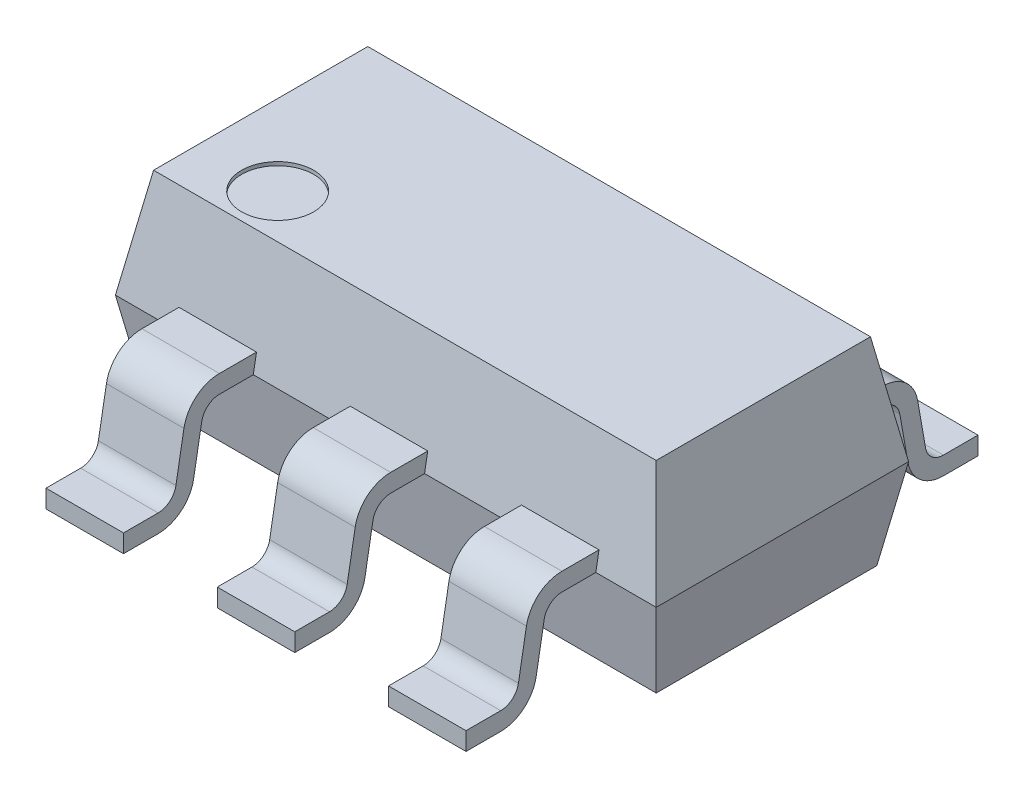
ISO-10303-21;
HEADER;
FILE_DESCRIPTION(('STEP AP214'),'2;1');
FILE_NAME('part.step','',(''),(''),'','','');
FILE_SCHEMA(('AUTOMOTIVE_DESIGN { 1 0 10303 214 1 1 1 1 }'));
ENDSEC;
DATA;
#1=APPLICATION_CONTEXT('core data for automotive mechanical design processes');
#2=APPLICATION_PROTOCOL_DEFINITION('international standard','automotive_design',2000,#1);
#3=PRODUCT_CONTEXT('',#1,'mechanical');
#4=PRODUCT('Part','Part','',(#3));
#5=PRODUCT_RELATED_PRODUCT_CATEGORY('part','',(#4));
#6=PRODUCT_DEFINITION_FORMATION('','',#4);
#7=PRODUCT_DEFINITION_CONTEXT('part definition',#1,'design');
#8=PRODUCT_DEFINITION('design','',#6,#7);
#9=PRODUCT_DEFINITION_SHAPE('','',#8);
#10=(LENGTH_UNIT() NAMED_UNIT(*) SI_UNIT(.MILLI.,.METRE.));
#11=(NAMED_UNIT(*) PLANE_ANGLE_UNIT() SI_UNIT($,.RADIAN.));
#12=(NAMED_UNIT(*) SI_UNIT($,.STERADIAN.) SOLID_ANGLE_UNIT());
#13=UNCERTAINTY_MEASURE_WITH_UNIT(LENGTH_MEASURE(1.E-05),#10,'distance_accuracy_value','');
#14=(GEOMETRIC_REPRESENTATION_CONTEXT(3) GLOBAL_UNCERTAINTY_ASSIGNED_CONTEXT((#13)) GLOBAL_UNIT_ASSIGNED_CONTEXT((#10,
#11,#12)) REPRESENTATION_CONTEXT('',''));
#15=CARTESIAN_POINT('',(0.,0.,0.));
#16=DIRECTION('',(0.,0.,1.));
#17=DIRECTION('',(1.,0.,0.));
#18=AXIS2_PLACEMENT_3D('',#15,#16,#17);
#19=CARTESIAN_POINT('',(-1.165,0.6,0.88792654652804));
#20=DIRECTION('',(0.,1.,0.));
#21=DIRECTION('',(0.,0.,1.));
#22=AXIS2_PLACEMENT_3D('',#19,#20,#21);
#23=PLANE('',#22);
#24=DIRECTION('',(1.,0.,0.));
#25=VECTOR('',#24,1.);
#26=CARTESIAN_POINT('',(-1.165,0.6,0.682367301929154));
#27=LINE('',#26,#25);
#28=CARTESIAN_POINT('',(-1.165,0.6,0.682367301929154));
#29=VERTEX_POINT('',#28);
#30=CARTESIAN_POINT('',(-0.735,0.6,0.682367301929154));
#31=VERTEX_POINT('',#30);
#32=EDGE_CURVE('E529',#29,#31,#27,.T.);
#33=ORIENTED_EDGE('',*,*,#32,.F.);
#34=DIRECTION('',(0.,0.,1.));
#35=VECTOR('',#34,1.);
#36=CARTESIAN_POINT('',(-1.165,0.6,0.88792654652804));
#37=LINE('',#36,#35);
#38=CARTESIAN_POINT('',(-1.165,0.6,0.88792654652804));
#39=VERTEX_POINT('',#38);
#40=EDGE_CURVE('E776',#29,#39,#37,.T.);
#41=ORIENTED_EDGE('',*,*,#40,.T.);
#42=DIRECTION('',(1.,0.,0.));
#43=VECTOR('',#42,1.);
#44=CARTESIAN_POINT('',(-1.165,0.6,0.88792654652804));
#45=LINE('',#44,#43);
#46=CARTESIAN_POINT('',(-0.735,0.6,0.88792654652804));
#47=VERTEX_POINT('',#46);
#48=EDGE_CURVE('E874',#39,#47,#45,.T.);
#49=ORIENTED_EDGE('',*,*,#48,.T.);
#50=DIRECTION('',(0.,0.,1.));
#51=VECTOR('',#50,1.);
#52=CARTESIAN_POINT('',(-0.735,0.6,1.42));
#53=LINE('',#52,#51);
#54=EDGE_CURVE('E670',#31,#47,#53,.T.);
#55=ORIENTED_EDGE('',*,*,#54,.F.);
#56=EDGE_LOOP('',(#33,#41,#49,#55));
#57=FACE_BOUND('',#56,.T.);
#58=ADVANCED_FACE('F32',(#57),#23,.T.);
#59=CARTESIAN_POINT('',(-1.165,0.5,0.88792654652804));
#60=DIRECTION('',(0.,-1.,0.));
#61=DIRECTION('',(0.,0.,-1.));
#62=AXIS2_PLACEMENT_3D('',#59,#60,#61);
#63=PLANE('',#62);
#64=DIRECTION('',(0.,0.,-1.));
#65=VECTOR('',#64,1.);
#66=CARTESIAN_POINT('',(-1.165,0.5,0.88792654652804));
#67=LINE('',#66,#65);
#68=CARTESIAN_POINT('',(-1.165,0.5,0.88792654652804));
#69=VERTEX_POINT('',#68);
#70=CARTESIAN_POINT('',(-1.165,0.5,0.7));
#71=VERTEX_POINT('',#70);
#72=EDGE_CURVE('E747',#69,#71,#67,.T.);
#73=ORIENTED_EDGE('',*,*,#72,.T.);
#74=DIRECTION('',(-1.,0.,0.));
#75=VECTOR('',#74,1.);
#76=CARTESIAN_POINT('',(-1.5,0.5,0.7));
#77=LINE('',#76,#75);
#78=CARTESIAN_POINT('',(-0.735,0.5,0.7));
#79=VERTEX_POINT('',#78);
#80=EDGE_CURVE('E457',#79,#71,#77,.T.);
#81=ORIENTED_EDGE('',*,*,#80,.F.);
#82=DIRECTION('',(0.,0.,1.));
#83=VECTOR('',#82,1.);
#84=CARTESIAN_POINT('',(-0.735,0.5,0.88792654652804));
#85=LINE('',#84,#83);
#86=CARTESIAN_POINT('',(-0.735,0.5,0.88792654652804));
#87=VERTEX_POINT('',#86);
#88=EDGE_CURVE('E715',#79,#87,#85,.T.);
#89=ORIENTED_EDGE('',*,*,#88,.T.);
#90=DIRECTION('',(1.,0.,0.));
#91=VECTOR('',#90,1.);
#92=CARTESIAN_POINT('',(-1.165,0.5,0.88792654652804));
#93=LINE('',#92,#91);
#94=EDGE_CURVE('E919',#69,#87,#93,.T.);
#95=ORIENTED_EDGE('',*,*,#94,.F.);
#96=EDGE_LOOP('',(#73,#81,#89,#95));
#97=FACE_BOUND('',#96,.T.);
#98=ADVANCED_FACE('F1001',(#97),#63,.T.);
#99=CARTESIAN_POINT('',(-1.165,0.2,1.22781992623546));
#100=DIRECTION('',(1.,0.,0.));
#101=DIRECTION('',(0.,0.,-1.));
#102=AXIS2_PLACEMENT_3D('',#99,#100,#101);
#103=PLANE('',#102);
#104=ORIENTED_EDGE('',*,*,#40,.F.);
#105=DIRECTION('',(0.,-0.984807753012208,0.173648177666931));
#106=VECTOR('',#105,1.);
#107=CARTESIAN_POINT('',(-1.165,0.118783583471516,0.767218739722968));
#108=LINE('',#107,#106);
#109=EDGE_CURVE('E55',#29,#71,#108,.T.);
#110=ORIENTED_EDGE('',*,*,#109,.T.);
#111=ORIENTED_EDGE('',*,*,#72,.F.);
#112=CARTESIAN_POINT('',(-1.165,0.4,0.88792654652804));
#113=DIRECTION('',(-1.,0.,0.));
#114=DIRECTION('',(0.,0.,1.));
#115=AXIS2_PLACEMENT_3D('',#112,#113,#114);
#116=CIRCLE('',#115,0.0999999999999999);
#117=CARTESIAN_POINT('',(-1.165,0.417364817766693,0.986407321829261));
#118=VERTEX_POINT('',#117);
#119=EDGE_CURVE('E743',#118,#69,#116,.T.);
#120=ORIENTED_EDGE('',*,*,#119,.F.);
#121=DIRECTION('',(0.,0.984807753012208,-0.173648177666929));
#122=VECTOR('',#121,1.);
#123=CARTESIAN_POINT('',(-1.165,0.165270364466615,1.03085837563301));
#124=LINE('',#123,#122);
#125=CARTESIAN_POINT('',(-1.165,0.165270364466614,1.03085837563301));
#126=VERTEX_POINT('',#125);
#127=EDGE_CURVE('E740',#126,#118,#124,.T.);
#128=ORIENTED_EDGE('',*,*,#127,.F.);
#129=CARTESIAN_POINT('',(-1.165,0.2,1.22781992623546));
#130=DIRECTION('',(1.,0.,0.));
#131=DIRECTION('',(0.,0.,-1.));
#132=AXIS2_PLACEMENT_3D('',#129,#130,#131);
#133=CIRCLE('',#132,0.2);
#134=CARTESIAN_POINT('',(-1.165,0.,1.22781992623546));
#135=VERTEX_POINT('',#134);
#136=EDGE_CURVE('E737',#135,#126,#133,.T.);
#137=ORIENTED_EDGE('',*,*,#136,.F.);
#138=DIRECTION('',(0.,0.,-1.));
#139=VECTOR('',#138,1.);
#140=CARTESIAN_POINT('',(-1.165,0.,1.42));
#141=LINE('',#140,#139);
#142=CARTESIAN_POINT('',(-1.165,0.,1.42));
#143=VERTEX_POINT('',#142);
#144=EDGE_CURVE('E733',#143,#135,#141,.T.);
#145=ORIENTED_EDGE('',*,*,#144,.F.);
#146=DIRECTION('',(0.,-1.,0.));
#147=VECTOR('',#146,1.);
#148=CARTESIAN_POINT('',(-1.165,0.,1.42));
#149=LINE('',#148,#147);
#150=CARTESIAN_POINT('',(-1.165,0.1,1.42));
#151=VERTEX_POINT('',#150);
#152=EDGE_CURVE('E730',#151,#143,#149,.T.);
#153=ORIENTED_EDGE('',*,*,#152,.F.);
#154=DIRECTION('',(0.,0.,1.));
#155=VECTOR('',#154,1.);
#156=CARTESIAN_POINT('',(-1.165,0.1,1.42));
#157=LINE('',#156,#155);
#158=CARTESIAN_POINT('',(-1.165,0.1,1.22781992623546));
#159=VERTEX_POINT('',#158);
#160=EDGE_CURVE('E789',#159,#151,#157,.T.);
#161=ORIENTED_EDGE('',*,*,#160,.F.);
#162=CARTESIAN_POINT('',(-1.165,0.2,1.22781992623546));
#163=DIRECTION('',(-1.,0.,0.));
#164=DIRECTION('',(0.,0.,-1.));
#165=AXIS2_PLACEMENT_3D('',#162,#163,#164);
#166=CIRCLE('',#165,0.1);
#167=CARTESIAN_POINT('',(-1.165,0.182635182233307,1.12933915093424));
#168=VERTEX_POINT('',#167);
#169=EDGE_CURVE('E786',#168,#159,#166,.T.);
#170=ORIENTED_EDGE('',*,*,#169,.F.);
#171=DIRECTION('',(0.,-0.984807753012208,0.173648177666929));
#172=VECTOR('',#171,1.);
#173=CARTESIAN_POINT('',(-1.165,0.182635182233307,1.12933915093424));
#174=LINE('',#173,#172);
#175=CARTESIAN_POINT('',(-1.165,0.434729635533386,1.08488809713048));
#176=VERTEX_POINT('',#175);
#177=EDGE_CURVE('E783',#176,#168,#174,.T.);
#178=ORIENTED_EDGE('',*,*,#177,.F.);
#179=CARTESIAN_POINT('',(-1.165,0.4,0.88792654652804));
#180=DIRECTION('',(1.,0.,0.));
#181=DIRECTION('',(0.,0.,1.));
#182=AXIS2_PLACEMENT_3D('',#179,#180,#181);
#183=CIRCLE('',#182,0.2);
#184=EDGE_CURVE('E780',#39,#176,#183,.T.);
#185=ORIENTED_EDGE('',*,*,#184,.F.);
#186=EDGE_LOOP('',(#104,#110,#111,#120,#128,#137,#145,#153,#161,#170,#178,#185));
#187=FACE_BOUND('',#186,.T.);
#188=ADVANCED_FACE('F976',(#187),#103,.F.);
#189=CARTESIAN_POINT('',(-1.165,0.,1.42));
#190=DIRECTION('',(0.,0.,1.));
#191=DIRECTION('',(1.,0.,0.));
#192=AXIS2_PLACEMENT_3D('',#189,#190,#191);
#193=PLANE('',#192);
#194=DIRECTION('',(1.,0.,0.));
#195=VECTOR('',#194,1.);
#196=CARTESIAN_POINT('',(-1.165,0.,1.42));
#197=LINE('',#196,#195);
#198=CARTESIAN_POINT('',(-0.735,0.,1.42));
#199=VERTEX_POINT('',#198);
#200=EDGE_CURVE('E939',#143,#199,#197,.T.);
#201=ORIENTED_EDGE('',*,*,#200,.T.);
#202=DIRECTION('',(0.,-1.,0.));
#203=VECTOR('',#202,1.);
#204=CARTESIAN_POINT('',(-0.735,0.6,1.42));
#205=LINE('',#204,#203);
#206=CARTESIAN_POINT('',(-0.735,0.1,1.42));
#207=VERTEX_POINT('',#206);
#208=EDGE_CURVE('E680',#207,#199,#205,.T.);
#209=ORIENTED_EDGE('',*,*,#208,.F.);
#210=DIRECTION('',(1.,0.,0.));
#211=VECTOR('',#210,1.);
#212=CARTESIAN_POINT('',(-1.165,0.1,1.42));
#213=LINE('',#212,#211);
#214=EDGE_CURVE('E853',#151,#207,#213,.T.);
#215=ORIENTED_EDGE('',*,*,#214,.F.);
#216=ORIENTED_EDGE('',*,*,#152,.T.);
#217=EDGE_LOOP('',(#201,#209,#215,#216));
#218=FACE_BOUND('',#217,.T.);
#219=ADVANCED_FACE('F34',(#218),#193,.T.);
#220=CARTESIAN_POINT('',(-1.165,0.1,1.42));
#221=DIRECTION('',(0.,1.,0.));
#222=DIRECTION('',(0.,0.,1.));
#223=AXIS2_PLACEMENT_3D('',#220,#221,#222);
#224=PLANE('',#223);
#225=ORIENTED_EDGE('',*,*,#214,.T.);
#226=DIRECTION('',(0.,0.,-1.));
#227=VECTOR('',#226,1.);
#228=CARTESIAN_POINT('',(-0.735,0.1,1.42));
#229=LINE('',#228,#227);
#230=CARTESIAN_POINT('',(-0.735,0.1,1.22781992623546));
#231=VERTEX_POINT('',#230);
#232=EDGE_CURVE('E726',#207,#231,#229,.T.);
#233=ORIENTED_EDGE('',*,*,#232,.T.);
#234=DIRECTION('',(1.,0.,0.));
#235=VECTOR('',#234,1.);
#236=CARTESIAN_POINT('',(-1.165,0.1,1.22781992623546));
#237=LINE('',#236,#235);
#238=EDGE_CURVE('E859',#159,#231,#237,.T.);
#239=ORIENTED_EDGE('',*,*,#238,.F.);
#240=ORIENTED_EDGE('',*,*,#160,.T.);
#241=EDGE_LOOP('',(#225,#233,#239,#240));
#242=FACE_BOUND('',#241,.T.);
#243=ADVANCED_FACE('F984',(#242),#224,.T.);
#244=CARTESIAN_POINT('',(-1.165,0.2,1.22781992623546));
#245=DIRECTION('',(1.,0.,0.));
#246=DIRECTION('',(0.,0.,-1.));
#247=AXIS2_PLACEMENT_3D('',#244,#245,#246);
#248=CYLINDRICAL_SURFACE('',#247,0.1);
#249=ORIENTED_EDGE('',*,*,#238,.T.);
#250=CARTESIAN_POINT('',(-0.735,0.2,1.22781992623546));
#251=DIRECTION('',(1.,0.,0.));
#252=DIRECTION('',(0.,0.,-1.));
#253=AXIS2_PLACEMENT_3D('',#250,#251,#252);
#254=CIRCLE('',#253,0.1);
#255=CARTESIAN_POINT('',(-0.735,0.182635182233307,1.12933915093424));
#256=VERTEX_POINT('',#255);
#257=EDGE_CURVE('E723',#231,#256,#254,.T.);
#258=ORIENTED_EDGE('',*,*,#257,.T.);
#259=DIRECTION('',(1.,0.,0.));
#260=VECTOR('',#259,1.);
#261=CARTESIAN_POINT('',(-1.165,0.182635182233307,1.12933915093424));
#262=LINE('',#261,#260);
#263=EDGE_CURVE('E864',#168,#256,#262,.T.);
#264=ORIENTED_EDGE('',*,*,#263,.F.);
#265=ORIENTED_EDGE('',*,*,#169,.T.);
#266=EDGE_LOOP('',(#249,#258,#264,#265));
#267=FACE_BOUND('',#266,.T.);
#268=ADVANCED_FACE('F982',(#267),#248,.F.);
#269=CARTESIAN_POINT('',(-1.165,0.182635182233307,1.12933915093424));
#270=DIRECTION('',(0.,0.173648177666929,0.984807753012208));
#271=DIRECTION('',(0.,-0.984807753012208,0.173648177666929));
#272=AXIS2_PLACEMENT_3D('',#269,#270,#271);
#273=PLANE('',#272);
#274=ORIENTED_EDGE('',*,*,#263,.T.);
#275=DIRECTION('',(0.,0.984807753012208,-0.173648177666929));
#276=VECTOR('',#275,1.);
#277=CARTESIAN_POINT('',(-0.735,0.182635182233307,1.12933915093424));
#278=LINE('',#277,#276);
#279=CARTESIAN_POINT('',(-0.735,0.434729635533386,1.08488809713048));
#280=VERTEX_POINT('',#279);
#281=EDGE_CURVE('E720',#256,#280,#278,.T.);
#282=ORIENTED_EDGE('',*,*,#281,.T.);
#283=DIRECTION('',(1.,0.,0.));
#284=VECTOR('',#283,1.);
#285=CARTESIAN_POINT('',(-1.165,0.434729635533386,1.08488809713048));
#286=LINE('',#285,#284);
#287=EDGE_CURVE('E869',#176,#280,#286,.T.);
#288=ORIENTED_EDGE('',*,*,#287,.F.);
#289=ORIENTED_EDGE('',*,*,#177,.T.);
#290=EDGE_LOOP('',(#274,#282,#288,#289));
#291=FACE_BOUND('',#290,.T.);
#292=ADVANCED_FACE('F980',(#291),#273,.T.);
#293=CARTESIAN_POINT('',(-1.165,0.4,0.88792654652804));
#294=DIRECTION('',(1.,0.,0.));
#295=DIRECTION('',(0.,0.,-1.));
#296=AXIS2_PLACEMENT_3D('',#293,#294,#295);
#297=CYLINDRICAL_SURFACE('',#296,0.2);
#298=ORIENTED_EDGE('',*,*,#287,.T.);
#299=CARTESIAN_POINT('',(-0.735,0.4,0.88792654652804));
#300=DIRECTION('',(1.,0.,0.));
#301=DIRECTION('',(0.,0.,-1.));
#302=AXIS2_PLACEMENT_3D('',#299,#300,#301);
#303=CIRCLE('',#302,0.2);
#304=EDGE_CURVE('E717',#280,#47,#303,.F.);
#305=ORIENTED_EDGE('',*,*,#304,.T.);
#306=ORIENTED_EDGE('',*,*,#48,.F.);
#307=ORIENTED_EDGE('',*,*,#184,.T.);
#308=EDGE_LOOP('',(#298,#305,#306,#307));
#309=FACE_BOUND('',#308,.T.);
#310=ADVANCED_FACE('F974',(#309),#297,.T.);
#311=CARTESIAN_POINT('',(-1.165,0.4,0.88792654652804));
#312=DIRECTION('',(1.,0.,0.));
#313=DIRECTION('',(0.,0.,-1.));
#314=AXIS2_PLACEMENT_3D('',#311,#312,#313);
#315=CYLINDRICAL_SURFACE('',#314,0.0999999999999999);
#316=ORIENTED_EDGE('',*,*,#94,.T.);
#317=CARTESIAN_POINT('',(-0.735,0.4,0.88792654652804));
#318=DIRECTION('',(1.,0.,0.));
#319=DIRECTION('',(0.,0.,-1.));
#320=AXIS2_PLACEMENT_3D('',#317,#318,#319);
#321=CIRCLE('',#320,0.0999999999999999);
#322=CARTESIAN_POINT('',(-0.735,0.417364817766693,0.986407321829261));
#323=VERTEX_POINT('',#322);
#324=EDGE_CURVE('E712',#87,#323,#321,.T.);
#325=ORIENTED_EDGE('',*,*,#324,.T.);
#326=DIRECTION('',(1.,0.,0.));
#327=VECTOR('',#326,1.);
#328=CARTESIAN_POINT('',(-1.165,0.417364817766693,0.986407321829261));
#329=LINE('',#328,#327);
#330=EDGE_CURVE('E924',#118,#323,#329,.T.);
#331=ORIENTED_EDGE('',*,*,#330,.F.);
#332=ORIENTED_EDGE('',*,*,#119,.T.);
#333=EDGE_LOOP('',(#316,#325,#331,#332));
#334=FACE_BOUND('',#333,.T.);
#335=ADVANCED_FACE('F999',(#334),#315,.F.);
#336=CARTESIAN_POINT('',(-1.165,0.165270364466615,1.03085837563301));
#337=DIRECTION('',(0.,-0.173648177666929,-0.984807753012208));
#338=DIRECTION('',(0.,0.984807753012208,-0.173648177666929));
#339=AXIS2_PLACEMENT_3D('',#336,#337,#338);
#340=PLANE('',#339);
#341=ORIENTED_EDGE('',*,*,#330,.T.);
#342=DIRECTION('',(0.,-0.984807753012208,0.173648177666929));
#343=VECTOR('',#342,1.);
#344=CARTESIAN_POINT('',(-0.735,0.165270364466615,1.03085837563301));
#345=LINE('',#344,#343);
#346=CARTESIAN_POINT('',(-0.735,0.165270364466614,1.03085837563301));
#347=VERTEX_POINT('',#346);
#348=EDGE_CURVE('E709',#323,#347,#345,.T.);
#349=ORIENTED_EDGE('',*,*,#348,.T.);
#350=DIRECTION('',(1.,0.,0.));
#351=VECTOR('',#350,1.);
#352=CARTESIAN_POINT('',(-1.165,0.165270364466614,1.03085837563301));
#353=LINE('',#352,#351);
#354=EDGE_CURVE('E929',#126,#347,#353,.T.);
#355=ORIENTED_EDGE('',*,*,#354,.F.);
#356=ORIENTED_EDGE('',*,*,#127,.T.);
#357=EDGE_LOOP('',(#341,#349,#355,#356));
#358=FACE_BOUND('',#357,.T.);
#359=ADVANCED_FACE('F997',(#358),#340,.T.);
#360=CARTESIAN_POINT('',(-1.165,0.2,1.22781992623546));
#361=DIRECTION('',(1.,0.,0.));
#362=DIRECTION('',(0.,0.,-1.));
#363=AXIS2_PLACEMENT_3D('',#360,#361,#362);
#364=CYLINDRICAL_SURFACE('',#363,0.2);
#365=ORIENTED_EDGE('',*,*,#354,.T.);
#366=CARTESIAN_POINT('',(-0.735,0.2,1.22781992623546));
#367=DIRECTION('',(1.,0.,0.));
#368=DIRECTION('',(0.,0.,-1.));
#369=AXIS2_PLACEMENT_3D('',#366,#367,#368);
#370=CIRCLE('',#369,0.2);
#371=CARTESIAN_POINT('',(-0.735,0.,1.22781992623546));
#372=VERTEX_POINT('',#371);
#373=EDGE_CURVE('E706',#347,#372,#370,.F.);
#374=ORIENTED_EDGE('',*,*,#373,.T.);
#375=DIRECTION('',(1.,0.,0.));
#376=VECTOR('',#375,1.);
#377=CARTESIAN_POINT('',(-1.165,0.,1.22781992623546));
#378=LINE('',#377,#376);
#379=EDGE_CURVE('E934',#135,#372,#378,.T.);
#380=ORIENTED_EDGE('',*,*,#379,.F.);
#381=ORIENTED_EDGE('',*,*,#136,.T.);
#382=EDGE_LOOP('',(#365,#374,#380,#381));
#383=FACE_BOUND('',#382,.T.);
#384=ADVANCED_FACE('F995',(#383),#364,.T.);
#385=CARTESIAN_POINT('',(-1.165,0.,1.42));
#386=DIRECTION('',(0.,-1.,0.));
#387=DIRECTION('',(0.,0.,-1.));
#388=AXIS2_PLACEMENT_3D('',#385,#386,#387);
#389=PLANE('',#388);
#390=ORIENTED_EDGE('',*,*,#379,.T.);
#391=DIRECTION('',(0.,0.,1.));
#392=VECTOR('',#391,1.);
#393=CARTESIAN_POINT('',(-0.735,0.,1.42));
#394=LINE('',#393,#392);
#395=EDGE_CURVE('E856',#372,#199,#394,.T.);
#396=ORIENTED_EDGE('',*,*,#395,.T.);
#397=ORIENTED_EDGE('',*,*,#200,.F.);
#398=ORIENTED_EDGE('',*,*,#144,.T.);
#399=EDGE_LOOP('',(#390,#396,#397,#398));
#400=FACE_BOUND('',#399,.T.);
#401=ADVANCED_FACE('F990',(#400),#389,.T.);
#402=CARTESIAN_POINT('',(-0.735,0.6,1.42));
#403=DIRECTION('',(1.,0.,0.));
#404=DIRECTION('',(0.,0.,-1.));
#405=AXIS2_PLACEMENT_3D('',#402,#403,#404);
#406=PLANE('',#405);
#407=DIRECTION('',(0.,-0.984807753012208,0.173648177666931));
#408=VECTOR('',#407,1.);
#409=CARTESIAN_POINT('',(-0.735,0.473857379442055,0.70460964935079));
#410=LINE('',#409,#408);
#411=EDGE_CURVE('E539',#31,#79,#410,.T.);
#412=ORIENTED_EDGE('',*,*,#411,.F.);
#413=ORIENTED_EDGE('',*,*,#54,.T.);
#414=ORIENTED_EDGE('',*,*,#304,.F.);
#415=ORIENTED_EDGE('',*,*,#281,.F.);
#416=ORIENTED_EDGE('',*,*,#257,.F.);
#417=ORIENTED_EDGE('',*,*,#232,.F.);
#418=ORIENTED_EDGE('',*,*,#208,.T.);
#419=ORIENTED_EDGE('',*,*,#395,.F.);
#420=ORIENTED_EDGE('',*,*,#373,.F.);
#421=ORIENTED_EDGE('',*,*,#348,.F.);
#422=ORIENTED_EDGE('',*,*,#324,.F.);
#423=ORIENTED_EDGE('',*,*,#88,.F.);
#424=EDGE_LOOP('',(#412,#413,#414,#415,#416,#417,#418,#419,#420,#421,#422,#423));
#425=FACE_BOUND('',#424,.T.);
#426=ADVANCED_FACE('F968',(#425),#406,.T.);
#427=CARTESIAN_POINT('',(-1.5,0.5,-0.7));
#428=DIRECTION('',(0.,0.173648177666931,-0.984807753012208));
#429=DIRECTION('',(0.,0.984807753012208,0.173648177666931));
#430=AXIS2_PLACEMENT_3D('',#427,#428,#429);
#431=PLANE('',#430);
#432=DIRECTION('',(0.,0.984807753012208,0.173648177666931));
#433=VECTOR('',#432,1.);
#434=CARTESIAN_POINT('',(-1.165,0.53872273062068,-0.693172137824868));
#435=LINE('',#434,#433);
#436=CARTESIAN_POINT('',(-1.165,0.5,-0.7));
#437=VERTEX_POINT('',#436);
#438=CARTESIAN_POINT('',(-1.165,0.6,-0.682367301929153));
#439=VERTEX_POINT('',#438);
#440=EDGE_CURVE('E553',#437,#439,#435,.T.);
#441=ORIENTED_EDGE('',*,*,#440,.F.);
#442=DIRECTION('',(1.,0.,0.));
#443=VECTOR('',#442,1.);
#444=CARTESIAN_POINT('',(-1.5,0.5,-0.7));
#445=LINE('',#444,#443);
#446=CARTESIAN_POINT('',(-1.5,0.5,-0.7));
#447=VERTEX_POINT('',#446);
#448=EDGE_CURVE('E510',#447,#437,#445,.T.);
#449=ORIENTED_EDGE('',*,*,#448,.F.);
#450=DIRECTION('',(-0.171087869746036,-0.970287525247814,-0.171087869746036));
#451=VECTOR('',#450,1.);
#452=CARTESIAN_POINT('',(-1.5,0.5,-0.7));
#453=LINE('',#452,#451);
#454=CARTESIAN_POINT('',(-1.39420381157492,1.1,-0.594203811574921));
#455=VERTEX_POINT('',#454);
#456=EDGE_CURVE('E472',#455,#447,#453,.T.);
#457=ORIENTED_EDGE('',*,*,#456,.F.);
#458=DIRECTION('',(1.,0.,0.));
#459=VECTOR('',#458,1.);
#460=CARTESIAN_POINT('',(-1.5,1.1,-0.594203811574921));
#461=LINE('',#460,#459);
#462=CARTESIAN_POINT('',(1.39420381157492,1.1,-0.594203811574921));
#463=VERTEX_POINT('',#462);
#464=EDGE_CURVE('E513',#455,#463,#461,.T.);
#465=ORIENTED_EDGE('',*,*,#464,.T.);
#466=DIRECTION('',(0.171087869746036,-0.970287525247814,-0.171087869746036));
#467=VECTOR('',#466,1.);
#468=CARTESIAN_POINT('',(1.41218682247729,0.998013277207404,-0.61218682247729));
#469=LINE('',#468,#467);
#470=CARTESIAN_POINT('',(1.5,0.5,-0.7));
#471=VERTEX_POINT('',#470);
#472=EDGE_CURVE('E477',#463,#471,#469,.T.);
#473=ORIENTED_EDGE('',*,*,#472,.T.);
#474=CARTESIAN_POINT('',(1.165,0.5,-0.7));
#475=VERTEX_POINT('',#474);
#476=EDGE_CURVE('E476',#475,#471,#445,.T.);
#477=ORIENTED_EDGE('',*,*,#476,.F.);
#478=DIRECTION('',(0.,0.984807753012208,0.173648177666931));
#479=VECTOR('',#478,1.);
#480=CARTESIAN_POINT('',(1.165,0.53872273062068,-0.693172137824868));
#481=LINE('',#480,#479);
#482=CARTESIAN_POINT('',(1.165,0.6,-0.682367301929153));
#483=VERTEX_POINT('',#482);
#484=EDGE_CURVE('E546',#475,#483,#481,.T.);
#485=ORIENTED_EDGE('',*,*,#484,.T.);
#486=DIRECTION('',(-1.,0.,0.));
#487=VECTOR('',#486,1.);
#488=CARTESIAN_POINT('',(-1.165,0.6,-0.682367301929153));
#489=LINE('',#488,#487);
#490=CARTESIAN_POINT('',(0.735,0.6,-0.682367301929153));
#491=VERTEX_POINT('',#490);
#492=EDGE_CURVE('E543',#483,#491,#489,.T.);
#493=ORIENTED_EDGE('',*,*,#492,.T.);
#494=DIRECTION('',(0.,-0.984807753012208,-0.173648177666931));
#495=VECTOR('',#494,1.);
#496=CARTESIAN_POINT('',(0.735,0.473857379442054,-0.704609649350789));
#497=LINE('',#496,#495);
#498=CARTESIAN_POINT('',(0.735,0.5,-0.7));
#499=VERTEX_POINT('',#498);
#500=EDGE_CURVE('E12',#491,#499,#497,.T.);
#501=ORIENTED_EDGE('',*,*,#500,.T.);
#502=CARTESIAN_POINT('',(-0.735,0.5,-0.7));
#503=VERTEX_POINT('',#502);
#504=EDGE_CURVE('E1256',#503,#499,#445,.T.);
#505=ORIENTED_EDGE('',*,*,#504,.F.);
#506=DIRECTION('',(0.,0.984807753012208,0.173648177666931));
#507=VECTOR('',#506,1.);
#508=CARTESIAN_POINT('',(-0.735,0.473857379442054,-0.704609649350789));
#509=LINE('',#508,#507);
#510=CARTESIAN_POINT('',(-0.735,0.6,-0.682367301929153));
#511=VERTEX_POINT('',#510);
#512=EDGE_CURVE('E550',#503,#511,#509,.T.);
#513=ORIENTED_EDGE('',*,*,#512,.T.);
#514=EDGE_CURVE('E547',#511,#439,#489,.T.);
#515=ORIENTED_EDGE('',*,*,#514,.T.);
#516=EDGE_LOOP('',(#441,#449,#457,#465,#473,#477,#485,#493,#501,#505,#513,#515));
#517=FACE_BOUND('',#516,.T.);
#518=ADVANCED_FACE('F1139',(#517),#431,.T.);
#519=CARTESIAN_POINT('',(-1.5,0.5,0.7));
#520=DIRECTION('',(0.,0.173648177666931,0.984807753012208));
#521=DIRECTION('',(0.,-0.984807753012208,0.173648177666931));
#522=AXIS2_PLACEMENT_3D('',#519,#520,#521);
#523=PLANE('',#522);
#524=ORIENTED_EDGE('',*,*,#109,.F.);
#525=ORIENTED_EDGE('',*,*,#32,.T.);
#526=ORIENTED_EDGE('',*,*,#411,.T.);
#527=CARTESIAN_POINT('',(-0.215,0.5,0.7));
#528=VERTEX_POINT('',#527);
#529=EDGE_CURVE('E963',#528,#79,#77,.T.);
#530=ORIENTED_EDGE('',*,*,#529,.F.);
#531=DIRECTION('',(0.,0.984807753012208,-0.173648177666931));
#532=VECTOR('',#531,1.);
#533=CARTESIAN_POINT('',(-0.215,0.473857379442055,0.70460964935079));
#534=LINE('',#533,#532);
#535=CARTESIAN_POINT('',(-0.215,0.6,0.682367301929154));
#536=VERTEX_POINT('',#535);
#537=EDGE_CURVE('E528',#528,#536,#534,.T.);
#538=ORIENTED_EDGE('',*,*,#537,.T.);
#539=CARTESIAN_POINT('',(0.215,0.6,0.682367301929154));
#540=VERTEX_POINT('',#539);
#541=EDGE_CURVE('E506',#536,#540,#27,.T.);
#542=ORIENTED_EDGE('',*,*,#541,.T.);
#543=DIRECTION('',(0.,-0.984807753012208,0.173648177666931));
#544=VECTOR('',#543,1.);
#545=CARTESIAN_POINT('',(0.215,0.473857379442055,0.70460964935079));
#546=LINE('',#545,#544);
#547=CARTESIAN_POINT('',(0.215,0.5,0.7));
#548=VERTEX_POINT('',#547);
#549=EDGE_CURVE('E40',#540,#548,#546,.T.);
#550=ORIENTED_EDGE('',*,*,#549,.T.);
#551=CARTESIAN_POINT('',(0.735,0.5,0.7));
#552=VERTEX_POINT('',#551);
#553=EDGE_CURVE('E956',#552,#548,#77,.T.);
#554=ORIENTED_EDGE('',*,*,#553,.F.);
#555=DIRECTION('',(0.,0.984807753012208,-0.173648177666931));
#556=VECTOR('',#555,1.);
#557=CARTESIAN_POINT('',(0.735,0.473857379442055,0.70460964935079));
#558=LINE('',#557,#556);
#559=CARTESIAN_POINT('',(0.735,0.6,0.682367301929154));
#560=VERTEX_POINT('',#559);
#561=EDGE_CURVE('E533',#552,#560,#558,.T.);
#562=ORIENTED_EDGE('',*,*,#561,.T.);
#563=CARTESIAN_POINT('',(1.165,0.6,0.682367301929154));
#564=VERTEX_POINT('',#563);
#565=EDGE_CURVE('E530',#560,#564,#27,.T.);
#566=ORIENTED_EDGE('',*,*,#565,.T.);
#567=DIRECTION('',(0.,-0.984807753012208,0.173648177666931));
#568=VECTOR('',#567,1.);
#569=CARTESIAN_POINT('',(1.165,0.118783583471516,0.767218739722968));
#570=LINE('',#569,#568);
#571=CARTESIAN_POINT('',(1.165,0.5,0.7));
#572=VERTEX_POINT('',#571);
#573=EDGE_CURVE('E536',#564,#572,#570,.T.);
#574=ORIENTED_EDGE('',*,*,#573,.T.);
#575=CARTESIAN_POINT('',(1.5,0.5,0.7));
#576=VERTEX_POINT('',#575);
#577=EDGE_CURVE('E462',#576,#572,#77,.T.);
#578=ORIENTED_EDGE('',*,*,#577,.F.);
#579=DIRECTION('',(0.171087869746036,-0.970287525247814,0.171087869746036));
#580=VECTOR('',#579,1.);
#581=CARTESIAN_POINT('',(1.45902051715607,0.732406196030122,0.659020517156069));
#582=LINE('',#581,#580);
#583=CARTESIAN_POINT('',(1.39420381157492,1.1,0.594203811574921));
#584=VERTEX_POINT('',#583);
#585=EDGE_CURVE('E516',#584,#576,#582,.T.);
#586=ORIENTED_EDGE('',*,*,#585,.F.);
#587=DIRECTION('',(-1.,0.,0.));
#588=VECTOR('',#587,1.);
#589=CARTESIAN_POINT('',(-1.5,1.1,0.594203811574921));
#590=LINE('',#589,#588);
#591=CARTESIAN_POINT('',(-1.39420381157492,1.1,0.594203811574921));
#592=VERTEX_POINT('',#591);
#593=EDGE_CURVE('E481',#584,#592,#590,.T.);
#594=ORIENTED_EDGE('',*,*,#593,.T.);
#595=DIRECTION('',(-0.171087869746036,-0.970287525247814,0.171087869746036));
#596=VECTOR('',#595,1.);
#597=CARTESIAN_POINT('',(-1.5,0.5,0.7));
#598=LINE('',#597,#596);
#599=CARTESIAN_POINT('',(-1.5,0.5,0.7));
#600=VERTEX_POINT('',#599);
#601=EDGE_CURVE('E469',#592,#600,#598,.T.);
#602=ORIENTED_EDGE('',*,*,#601,.T.);
#603=EDGE_CURVE('E449',#71,#600,#77,.T.);
#604=ORIENTED_EDGE('',*,*,#603,.F.);
#605=EDGE_LOOP('',(#524,#525,#526,#530,#538,#542,#550,#554,#562,#566,#574,#578,#586,#594,#602,#604));
#606=FACE_BOUND('',#605,.T.);
#607=ADVANCED_FACE('F479',(#606),#523,.T.);
#608=CARTESIAN_POINT('',(-1.5,0.5,-0.7));
#609=DIRECTION('',(-0.984807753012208,0.173648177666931,0.));
#610=DIRECTION('',(-0.173648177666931,-0.984807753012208,0.));
#611=AXIS2_PLACEMENT_3D('',#608,#609,#610);
#612=PLANE('',#611);
#613=ORIENTED_EDGE('',*,*,#601,.F.);
#614=DIRECTION('',(0.,0.,-1.));
#615=VECTOR('',#614,1.);
#616=CARTESIAN_POINT('',(-1.39420381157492,1.1,-0.7));
#617=LINE('',#616,#615);
#618=EDGE_CURVE('E517',#592,#455,#617,.T.);
#619=ORIENTED_EDGE('',*,*,#618,.T.);
#620=ORIENTED_EDGE('',*,*,#456,.T.);
#621=DIRECTION('',(0.,0.,-1.));
#622=VECTOR('',#621,1.);
#623=CARTESIAN_POINT('',(-1.5,0.5,-0.7));
#624=LINE('',#623,#622);
#625=EDGE_CURVE('E466',#600,#447,#624,.T.);
#626=ORIENTED_EDGE('',*,*,#625,.F.);
#627=EDGE_LOOP('',(#613,#619,#620,#626));
#628=FACE_BOUND('',#627,.T.);
#629=ADVANCED_FACE('F467',(#628),#612,.T.);
#630=CARTESIAN_POINT('',(1.5,0.5,-0.7));
#631=DIRECTION('',(0.984807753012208,0.173648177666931,0.));
#632=DIRECTION('',(-0.173648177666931,0.984807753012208,0.));
#633=AXIS2_PLACEMENT_3D('',#630,#631,#632);
#634=PLANE('',#633);
#635=ORIENTED_EDGE('',*,*,#472,.F.);
#636=DIRECTION('',(0.,0.,1.));
#637=VECTOR('',#636,1.);
#638=CARTESIAN_POINT('',(1.39420381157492,1.1,-0.7));
#639=LINE('',#638,#637);
#640=EDGE_CURVE('E482',#463,#584,#639,.T.);
#641=ORIENTED_EDGE('',*,*,#640,.T.);
#642=ORIENTED_EDGE('',*,*,#585,.T.);
#643=DIRECTION('',(0.,0.,1.));
#644=VECTOR('',#643,1.);
#645=CARTESIAN_POINT('',(1.5,0.5,-0.7));
#646=LINE('',#645,#644);
#647=EDGE_CURVE('E460',#471,#576,#646,.T.);
#648=ORIENTED_EDGE('',*,*,#647,.F.);
#649=EDGE_LOOP('',(#635,#641,#642,#648));
#650=FACE_BOUND('',#649,.T.);
#651=ADVANCED_FACE('F1134',(#650),#634,.T.);
#652=CARTESIAN_POINT('',(0.,1.1,0.));
#653=DIRECTION('',(0.,1.,0.));
#654=DIRECTION('',(0.,0.,1.));
#655=AXIS2_PLACEMENT_3D('',#652,#653,#654);
#656=PLANE('',#655);
#657=CARTESIAN_POINT('',(-0.95,1.1,0.35));
#658=DIRECTION('',(0.,1.,0.));
#659=DIRECTION('',(0.,0.,1.));
#660=AXIS2_PLACEMENT_3D('',#657,#658,#659);
#661=CIRCLE('',#660,0.2);
#662=CARTESIAN_POINT('',(-0.95,1.1,0.55));
#663=VERTEX_POINT('',#662);
#664=EDGE_CURVE('E494',#663,#663,#661,.T.);
#665=ORIENTED_EDGE('',*,*,#664,.F.);
#666=EDGE_LOOP('',(#665));
#667=FACE_BOUND('',#666,.T.);
#668=ORIENTED_EDGE('',*,*,#618,.F.);
#669=ORIENTED_EDGE('',*,*,#593,.F.);
#670=ORIENTED_EDGE('',*,*,#640,.F.);
#671=ORIENTED_EDGE('',*,*,#464,.F.);
#672=EDGE_LOOP('',(#668,#669,#670,#671));
#673=FACE_BOUND('',#672,.T.);
#674=ADVANCED_FACE('F1136',(#667,#673),#656,.T.);
#675=CARTESIAN_POINT('',(-1.5,0.5,0.7));
#676=DIRECTION('',(0.,-0.173648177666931,0.984807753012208));
#677=DIRECTION('',(0.,-0.984807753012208,-0.173648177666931));
#678=AXIS2_PLACEMENT_3D('',#675,#676,#677);
#679=PLANE('',#678);
#680=DIRECTION('',(-0.171087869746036,0.970287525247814,0.171087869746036));
#681=VECTOR('',#680,1.);
#682=CARTESIAN_POINT('',(-1.45902051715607,0.267593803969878,0.659020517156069));
#683=LINE('',#682,#681);
#684=CARTESIAN_POINT('',(-1.41183650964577,0.,0.611836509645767));
#685=VERTEX_POINT('',#684);
#686=EDGE_CURVE('E454',#685,#600,#683,.T.);
#687=ORIENTED_EDGE('',*,*,#686,.F.);
#688=DIRECTION('',(-1.,0.,0.));
#689=VECTOR('',#688,1.);
#690=CARTESIAN_POINT('',(-1.5,0.,0.611836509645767));
#691=LINE('',#690,#689);
#692=CARTESIAN_POINT('',(1.41183650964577,0.,0.611836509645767));
#693=VERTEX_POINT('',#692);
#694=EDGE_CURVE('E502',#685,#693,#691,.F.);
#695=ORIENTED_EDGE('',*,*,#694,.T.);
#696=DIRECTION('',(0.171087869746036,0.970287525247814,0.171087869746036));
#697=VECTOR('',#696,1.);
#698=CARTESIAN_POINT('',(1.41218682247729,0.00198672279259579,0.612186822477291));
#699=LINE('',#698,#697);
#700=EDGE_CURVE('E487',#693,#576,#699,.T.);
#701=ORIENTED_EDGE('',*,*,#700,.T.);
#702=ORIENTED_EDGE('',*,*,#577,.T.);
#703=EDGE_CURVE('E507',#572,#552,#77,.T.);
#704=ORIENTED_EDGE('',*,*,#703,.T.);
#705=ORIENTED_EDGE('',*,*,#553,.T.);
#706=EDGE_CURVE('E962',#548,#528,#77,.T.);
#707=ORIENTED_EDGE('',*,*,#706,.T.);
#708=ORIENTED_EDGE('',*,*,#529,.T.);
#709=ORIENTED_EDGE('',*,*,#80,.T.);
#710=ORIENTED_EDGE('',*,*,#603,.T.);
#711=EDGE_LOOP('',(#687,#695,#701,#702,#704,#705,#707,#708,#709,#710));
#712=FACE_BOUND('',#711,.T.);
#713=ADVANCED_FACE('F451',(#712),#679,.T.);
#714=CARTESIAN_POINT('',(1.5,0.5,-0.7));
#715=DIRECTION('',(0.984807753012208,-0.173648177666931,0.));
#716=DIRECTION('',(0.173648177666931,0.984807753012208,0.));
#717=AXIS2_PLACEMENT_3D('',#714,#715,#716);
#718=PLANE('',#717);
#719=ORIENTED_EDGE('',*,*,#700,.F.);
#720=DIRECTION('',(0.,0.,1.));
#721=VECTOR('',#720,1.);
#722=CARTESIAN_POINT('',(1.41183650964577,0.,-0.7));
#723=LINE('',#722,#721);
#724=CARTESIAN_POINT('',(1.41183650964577,0.,-0.611836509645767));
#725=VERTEX_POINT('',#724);
#726=EDGE_CURVE('E503',#693,#725,#723,.F.);
#727=ORIENTED_EDGE('',*,*,#726,.T.);
#728=DIRECTION('',(0.171087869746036,0.970287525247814,-0.171087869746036));
#729=VECTOR('',#728,1.);
#730=CARTESIAN_POINT('',(1.5,0.5,-0.7));
#731=LINE('',#730,#729);
#732=EDGE_CURVE('E491',#725,#471,#731,.T.);
#733=ORIENTED_EDGE('',*,*,#732,.T.);
#734=ORIENTED_EDGE('',*,*,#647,.T.);
#735=EDGE_LOOP('',(#719,#727,#733,#734));
#736=FACE_BOUND('',#735,.T.);
#737=ADVANCED_FACE('F1130',(#736),#718,.T.);
#738=CARTESIAN_POINT('',(-1.5,0.5,-0.7));
#739=DIRECTION('',(0.,-0.173648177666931,-0.984807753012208));
#740=DIRECTION('',(0.,0.984807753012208,-0.173648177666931));
#741=AXIS2_PLACEMENT_3D('',#738,#739,#740);
#742=PLANE('',#741);
#743=ORIENTED_EDGE('',*,*,#732,.F.);
#744=DIRECTION('',(1.,0.,0.));
#745=VECTOR('',#744,1.);
#746=CARTESIAN_POINT('',(-1.5,0.,-0.611836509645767));
#747=LINE('',#746,#745);
#748=CARTESIAN_POINT('',(-1.41183650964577,0.,-0.611836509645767));
#749=VERTEX_POINT('',#748);
#750=EDGE_CURVE('E1145',#725,#749,#747,.F.);
#751=ORIENTED_EDGE('',*,*,#750,.T.);
#752=DIRECTION('',(-0.171087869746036,0.970287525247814,-0.171087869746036));
#753=VECTOR('',#752,1.);
#754=CARTESIAN_POINT('',(-1.5,0.5,-0.7));
#755=LINE('',#754,#753);
#756=EDGE_CURVE('E497',#749,#447,#755,.T.);
#757=ORIENTED_EDGE('',*,*,#756,.T.);
#758=ORIENTED_EDGE('',*,*,#448,.T.);
#759=EDGE_CURVE('E47',#437,#503,#445,.T.);
#760=ORIENTED_EDGE('',*,*,#759,.T.);
#761=ORIENTED_EDGE('',*,*,#504,.T.);
#762=EDGE_CURVE('E1246',#499,#475,#445,.T.);
#763=ORIENTED_EDGE('',*,*,#762,.T.);
#764=ORIENTED_EDGE('',*,*,#476,.T.);
#765=EDGE_LOOP('',(#743,#751,#757,#758,#760,#761,#763,#764));
#766=FACE_BOUND('',#765,.T.);
#767=ADVANCED_FACE('F1144',(#766),#742,.T.);
#768=CARTESIAN_POINT('',(-1.5,0.5,-0.7));
#769=DIRECTION('',(-0.984807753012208,-0.173648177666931,0.));
#770=DIRECTION('',(0.173648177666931,-0.984807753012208,0.));
#771=AXIS2_PLACEMENT_3D('',#768,#769,#770);
#772=PLANE('',#771);
#773=ORIENTED_EDGE('',*,*,#756,.F.);
#774=DIRECTION('',(0.,0.,-1.));
#775=VECTOR('',#774,1.);
#776=CARTESIAN_POINT('',(-1.41183650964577,0.,-0.7));
#777=LINE('',#776,#775);
#778=EDGE_CURVE('E486',#749,#685,#777,.F.);
#779=ORIENTED_EDGE('',*,*,#778,.T.);
#780=ORIENTED_EDGE('',*,*,#686,.T.);
#781=ORIENTED_EDGE('',*,*,#625,.T.);
#782=EDGE_LOOP('',(#773,#779,#780,#781));
#783=FACE_BOUND('',#782,.T.);
#784=ADVANCED_FACE('F485',(#783),#772,.T.);
#785=CARTESIAN_POINT('',(0.,0.,0.));
#786=DIRECTION('',(0.,1.,0.));
#787=DIRECTION('',(0.,0.,1.));
#788=AXIS2_PLACEMENT_3D('',#785,#786,#787);
#789=PLANE('',#788);
#790=ORIENTED_EDGE('',*,*,#750,.F.);
#791=ORIENTED_EDGE('',*,*,#726,.F.);
#792=ORIENTED_EDGE('',*,*,#694,.F.);
#793=ORIENTED_EDGE('',*,*,#778,.F.);
#794=EDGE_LOOP('',(#790,#791,#792,#793));
#795=FACE_BOUND('',#794,.T.);
#796=ADVANCED_FACE('F1454',(#795),#789,.F.);
#797=CARTESIAN_POINT('',(-0.215,0.5,0.88792654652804));
#798=VERTEX_POINT('',#797);
#799=CARTESIAN_POINT('',(0.215,0.5,0.88792654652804));
#800=VERTEX_POINT('',#799);
#801=EDGE_CURVE('E922',#798,#800,#93,.T.);
#802=ORIENTED_EDGE('',*,*,#801,.T.);
#803=CARTESIAN_POINT('',(0.215,0.4,0.88792654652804));
#804=DIRECTION('',(1.,0.,0.));
#805=DIRECTION('',(0.,0.,-1.));
#806=AXIS2_PLACEMENT_3D('',#803,#804,#805);
#807=CIRCLE('',#806,0.0999999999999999);
#808=CARTESIAN_POINT('',(0.215,0.417364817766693,0.986407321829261));
#809=VERTEX_POINT('',#808);
#810=EDGE_CURVE('E573',#800,#809,#807,.T.);
#811=ORIENTED_EDGE('',*,*,#810,.T.);
#812=CARTESIAN_POINT('',(-0.215,0.417364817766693,0.986407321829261));
#813=VERTEX_POINT('',#812);
#814=EDGE_CURVE('E927',#813,#809,#329,.T.);
#815=ORIENTED_EDGE('',*,*,#814,.F.);
#816=CARTESIAN_POINT('',(-0.215,0.4,0.88792654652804));
#817=DIRECTION('',(-1.,0.,0.));
#818=DIRECTION('',(0.,0.,1.));
#819=AXIS2_PLACEMENT_3D('',#816,#817,#818);
#820=CIRCLE('',#819,0.0999999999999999);
#821=EDGE_CURVE('E688',#813,#798,#820,.T.);
#822=ORIENTED_EDGE('',*,*,#821,.T.);
#823=EDGE_LOOP('',(#802,#811,#815,#822));
#824=FACE_BOUND('',#823,.T.);
#825=ADVANCED_FACE('F1075',(#824),#315,.F.);
#826=ORIENTED_EDGE('',*,*,#814,.T.);
#827=DIRECTION('',(0.,-0.984807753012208,0.173648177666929));
#828=VECTOR('',#827,1.);
#829=CARTESIAN_POINT('',(0.215,0.165270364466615,1.03085837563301));
#830=LINE('',#829,#828);
#831=CARTESIAN_POINT('',(0.215,0.165270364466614,1.03085837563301));
#832=VERTEX_POINT('',#831);
#833=EDGE_CURVE('E570',#809,#832,#830,.T.);
#834=ORIENTED_EDGE('',*,*,#833,.T.);
#835=CARTESIAN_POINT('',(-0.215,0.165270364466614,1.03085837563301));
#836=VERTEX_POINT('',#835);
#837=EDGE_CURVE('E932',#836,#832,#353,.T.);
#838=ORIENTED_EDGE('',*,*,#837,.F.);
#839=DIRECTION('',(0.,0.984807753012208,-0.173648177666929));
#840=VECTOR('',#839,1.);
#841=CARTESIAN_POINT('',(-0.215,0.165270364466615,1.03085837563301));
#842=LINE('',#841,#840);
#843=EDGE_CURVE('E685',#836,#813,#842,.T.);
#844=ORIENTED_EDGE('',*,*,#843,.T.);
#845=EDGE_LOOP('',(#826,#834,#838,#844));
#846=FACE_BOUND('',#845,.T.);
#847=ADVANCED_FACE('F1070',(#846),#340,.T.);
#848=ORIENTED_EDGE('',*,*,#837,.T.);
#849=CARTESIAN_POINT('',(0.215,0.2,1.22781992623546));
#850=DIRECTION('',(1.,0.,0.));
#851=DIRECTION('',(0.,0.,-1.));
#852=AXIS2_PLACEMENT_3D('',#849,#850,#851);
#853=CIRCLE('',#852,0.2);
#854=CARTESIAN_POINT('',(0.215,0.,1.22781992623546));
#855=VERTEX_POINT('',#854);
#856=EDGE_CURVE('E567',#832,#855,#853,.F.);
#857=ORIENTED_EDGE('',*,*,#856,.T.);
#858=CARTESIAN_POINT('',(-0.215,0.,1.22781992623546));
#859=VERTEX_POINT('',#858);
#860=EDGE_CURVE('E937',#859,#855,#378,.T.);
#861=ORIENTED_EDGE('',*,*,#860,.F.);
#862=CARTESIAN_POINT('',(-0.215,0.2,1.22781992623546));
#863=DIRECTION('',(-1.,0.,0.));
#864=DIRECTION('',(0.,0.,1.));
#865=AXIS2_PLACEMENT_3D('',#862,#863,#864);
#866=CIRCLE('',#865,0.2);
#867=EDGE_CURVE('E682',#859,#836,#866,.F.);
#868=ORIENTED_EDGE('',*,*,#867,.T.);
#869=EDGE_LOOP('',(#848,#857,#861,#868));
#870=FACE_BOUND('',#869,.T.);
#871=ADVANCED_FACE('F1082',(#870),#364,.T.);
#872=ORIENTED_EDGE('',*,*,#860,.T.);
#873=DIRECTION('',(0.,0.,1.));
#874=VECTOR('',#873,1.);
#875=CARTESIAN_POINT('',(0.215,0.,1.42));
#876=LINE('',#875,#874);
#877=CARTESIAN_POINT('',(0.215,0.,1.42));
#878=VERTEX_POINT('',#877);
#879=EDGE_CURVE('E951',#855,#878,#876,.T.);
#880=ORIENTED_EDGE('',*,*,#879,.T.);
#881=CARTESIAN_POINT('',(-0.215,0.,1.42));
#882=VERTEX_POINT('',#881);
#883=EDGE_CURVE('E942',#882,#878,#197,.T.);
#884=ORIENTED_EDGE('',*,*,#883,.F.);
#885=DIRECTION('',(0.,0.,-1.));
#886=VECTOR('',#885,1.);
#887=CARTESIAN_POINT('',(-0.215,0.,1.42));
#888=LINE('',#887,#886);
#889=EDGE_CURVE('E669',#882,#859,#888,.T.);
#890=ORIENTED_EDGE('',*,*,#889,.T.);
#891=EDGE_LOOP('',(#872,#880,#884,#890));
#892=FACE_BOUND('',#891,.T.);
#893=ADVANCED_FACE('F1084',(#892),#389,.T.);
#894=ORIENTED_EDGE('',*,*,#883,.T.);
#895=DIRECTION('',(0.,-1.,0.));
#896=VECTOR('',#895,1.);
#897=CARTESIAN_POINT('',(0.215,0.6,1.42));
#898=LINE('',#897,#896);
#899=CARTESIAN_POINT('',(0.215,0.1,1.42));
#900=VERTEX_POINT('',#899);
#901=EDGE_CURVE('E560',#900,#878,#898,.T.);
#902=ORIENTED_EDGE('',*,*,#901,.F.);
#903=CARTESIAN_POINT('',(-0.215,0.1,1.42));
#904=VERTEX_POINT('',#903);
#905=EDGE_CURVE('E857',#904,#900,#213,.T.);
#906=ORIENTED_EDGE('',*,*,#905,.F.);
#907=DIRECTION('',(0.,-1.,0.));
#908=VECTOR('',#907,1.);
#909=CARTESIAN_POINT('',(-0.215,0.6,1.42));
#910=LINE('',#909,#908);
#911=EDGE_CURVE('E675',#904,#882,#910,.T.);
#912=ORIENTED_EDGE('',*,*,#911,.T.);
#913=EDGE_LOOP('',(#894,#902,#906,#912));
#914=FACE_BOUND('',#913,.T.);
#915=ADVANCED_FACE('F1104',(#914),#193,.T.);
#916=ORIENTED_EDGE('',*,*,#905,.T.);
#917=DIRECTION('',(0.,0.,-1.));
#918=VECTOR('',#917,1.);
#919=CARTESIAN_POINT('',(0.215,0.1,1.42));
#920=LINE('',#919,#918);
#921=CARTESIAN_POINT('',(0.215,0.1,1.22781992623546));
#922=VERTEX_POINT('',#921);
#923=EDGE_CURVE('E587',#900,#922,#920,.T.);
#924=ORIENTED_EDGE('',*,*,#923,.T.);
#925=CARTESIAN_POINT('',(-0.215,0.1,1.22781992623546));
#926=VERTEX_POINT('',#925);
#927=EDGE_CURVE('E862',#926,#922,#237,.T.);
#928=ORIENTED_EDGE('',*,*,#927,.F.);
#929=DIRECTION('',(0.,0.,1.));
#930=VECTOR('',#929,1.);
#931=CARTESIAN_POINT('',(-0.215,0.1,1.42));
#932=LINE('',#931,#930);
#933=EDGE_CURVE('E703',#926,#904,#932,.T.);
#934=ORIENTED_EDGE('',*,*,#933,.T.);
#935=EDGE_LOOP('',(#916,#924,#928,#934));
#936=FACE_BOUND('',#935,.T.);
#937=ADVANCED_FACE('F1110',(#936),#224,.T.);
#938=ORIENTED_EDGE('',*,*,#927,.T.);
#939=CARTESIAN_POINT('',(0.215,0.2,1.22781992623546));
#940=DIRECTION('',(1.,0.,0.));
#941=DIRECTION('',(0.,0.,-1.));
#942=AXIS2_PLACEMENT_3D('',#939,#940,#941);
#943=CIRCLE('',#942,0.1);
#944=CARTESIAN_POINT('',(0.215,0.182635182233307,1.12933915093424));
#945=VERTEX_POINT('',#944);
#946=EDGE_CURVE('E584',#922,#945,#943,.T.);
#947=ORIENTED_EDGE('',*,*,#946,.T.);
#948=CARTESIAN_POINT('',(-0.215,0.182635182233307,1.12933915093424));
#949=VERTEX_POINT('',#948);
#950=EDGE_CURVE('E867',#949,#945,#262,.T.);
#951=ORIENTED_EDGE('',*,*,#950,.F.);
#952=CARTESIAN_POINT('',(-0.215,0.2,1.22781992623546));
#953=DIRECTION('',(-1.,0.,0.));
#954=DIRECTION('',(0.,0.,1.));
#955=AXIS2_PLACEMENT_3D('',#952,#953,#954);
#956=CIRCLE('',#955,0.1);
#957=EDGE_CURVE('E700',#949,#926,#956,.T.);
#958=ORIENTED_EDGE('',*,*,#957,.T.);
#959=EDGE_LOOP('',(#938,#947,#951,#958));
#960=FACE_BOUND('',#959,.T.);
#961=ADVANCED_FACE('F1183',(#960),#248,.F.);
#962=ORIENTED_EDGE('',*,*,#950,.T.);
#963=DIRECTION('',(0.,0.984807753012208,-0.173648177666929));
#964=VECTOR('',#963,1.);
#965=CARTESIAN_POINT('',(0.215,0.182635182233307,1.12933915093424));
#966=LINE('',#965,#964);
#967=CARTESIAN_POINT('',(0.215,0.434729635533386,1.08488809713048));
#968=VERTEX_POINT('',#967);
#969=EDGE_CURVE('E581',#945,#968,#966,.T.);
#970=ORIENTED_EDGE('',*,*,#969,.T.);
#971=CARTESIAN_POINT('',(-0.215,0.434729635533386,1.08488809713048));
#972=VERTEX_POINT('',#971);
#973=EDGE_CURVE('E872',#972,#968,#286,.T.);
#974=ORIENTED_EDGE('',*,*,#973,.F.);
#975=DIRECTION('',(0.,-0.984807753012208,0.173648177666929));
#976=VECTOR('',#975,1.);
#977=CARTESIAN_POINT('',(-0.215,0.182635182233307,1.12933915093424));
#978=LINE('',#977,#976);
#979=EDGE_CURVE('E697',#972,#949,#978,.T.);
#980=ORIENTED_EDGE('',*,*,#979,.T.);
#981=EDGE_LOOP('',(#962,#970,#974,#980));
#982=FACE_BOUND('',#981,.T.);
#983=ADVANCED_FACE('F1187',(#982),#273,.T.);
#984=ORIENTED_EDGE('',*,*,#973,.T.);
#985=CARTESIAN_POINT('',(0.215,0.4,0.88792654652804));
#986=DIRECTION('',(1.,0.,0.));
#987=DIRECTION('',(0.,0.,-1.));
#988=AXIS2_PLACEMENT_3D('',#985,#986,#987);
#989=CIRCLE('',#988,0.2);
#990=CARTESIAN_POINT('',(0.215,0.6,0.88792654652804));
#991=VERTEX_POINT('',#990);
#992=EDGE_CURVE('E578',#968,#991,#989,.F.);
#993=ORIENTED_EDGE('',*,*,#992,.T.);
#994=CARTESIAN_POINT('',(-0.215,0.6,0.88792654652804));
#995=VERTEX_POINT('',#994);
#996=EDGE_CURVE('E877',#995,#991,#45,.T.);
#997=ORIENTED_EDGE('',*,*,#996,.F.);
#998=CARTESIAN_POINT('',(-0.215,0.4,0.88792654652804));
#999=DIRECTION('',(-1.,0.,0.));
#1000=DIRECTION('',(0.,0.,1.));
#1001=AXIS2_PLACEMENT_3D('',#998,#999,#1000);
#1002=CIRCLE('',#1001,0.2);
#1003=EDGE_CURVE('E694',#995,#972,#1002,.F.);
#1004=ORIENTED_EDGE('',*,*,#1003,.T.);
#1005=EDGE_LOOP('',(#984,#993,#997,#1004));
#1006=FACE_BOUND('',#1005,.T.);
#1007=ADVANCED_FACE('F1166',(#1006),#297,.T.);
#1008=CARTESIAN_POINT('',(0.215,0.6,1.42));
#1009=DIRECTION('',(1.,0.,0.));
#1010=DIRECTION('',(0.,0.,-1.));
#1011=AXIS2_PLACEMENT_3D('',#1008,#1009,#1010);
#1012=PLANE('',#1011);
#1013=ORIENTED_EDGE('',*,*,#549,.F.);
#1014=DIRECTION('',(0.,0.,1.));
#1015=VECTOR('',#1014,1.);
#1016=CARTESIAN_POINT('',(0.215,0.6,1.42));
#1017=LINE('',#1016,#1015);
#1018=EDGE_CURVE('E558',#540,#991,#1017,.T.);
#1019=ORIENTED_EDGE('',*,*,#1018,.T.);
#1020=ORIENTED_EDGE('',*,*,#992,.F.);
#1021=ORIENTED_EDGE('',*,*,#969,.F.);
#1022=ORIENTED_EDGE('',*,*,#946,.F.);
#1023=ORIENTED_EDGE('',*,*,#923,.F.);
#1024=ORIENTED_EDGE('',*,*,#901,.T.);
#1025=ORIENTED_EDGE('',*,*,#879,.F.);
#1026=ORIENTED_EDGE('',*,*,#856,.F.);
#1027=ORIENTED_EDGE('',*,*,#833,.F.);
#1028=ORIENTED_EDGE('',*,*,#810,.F.);
#1029=DIRECTION('',(0.,0.,1.));
#1030=VECTOR('',#1029,1.);
#1031=CARTESIAN_POINT('',(0.215,0.5,0.88792654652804));
#1032=LINE('',#1031,#1030);
#1033=EDGE_CURVE('E576',#548,#800,#1032,.T.);
#1034=ORIENTED_EDGE('',*,*,#1033,.F.);
#1035=EDGE_LOOP('',(#1013,#1019,#1020,#1021,#1022,#1023,#1024,#1025,#1026,#1027,#1028,#1034));
#1036=FACE_BOUND('',#1035,.T.);
#1037=ADVANCED_FACE('F1078',(#1036),#1012,.T.);
#1038=CARTESIAN_POINT('',(-0.215,0.6,1.42));
#1039=DIRECTION('',(-1.,0.,0.));
#1040=DIRECTION('',(0.,0.,1.));
#1041=AXIS2_PLACEMENT_3D('',#1038,#1039,#1040);
#1042=PLANE('',#1041);
#1043=ORIENTED_EDGE('',*,*,#537,.F.);
#1044=DIRECTION('',(0.,0.,-1.));
#1045=VECTOR('',#1044,1.);
#1046=CARTESIAN_POINT('',(-0.215,0.5,0.88792654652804));
#1047=LINE('',#1046,#1045);
#1048=EDGE_CURVE('E691',#798,#528,#1047,.T.);
#1049=ORIENTED_EDGE('',*,*,#1048,.F.);
#1050=ORIENTED_EDGE('',*,*,#821,.F.);
#1051=ORIENTED_EDGE('',*,*,#843,.F.);
#1052=ORIENTED_EDGE('',*,*,#867,.F.);
#1053=ORIENTED_EDGE('',*,*,#889,.F.);
#1054=ORIENTED_EDGE('',*,*,#911,.F.);
#1055=ORIENTED_EDGE('',*,*,#933,.F.);
#1056=ORIENTED_EDGE('',*,*,#957,.F.);
#1057=ORIENTED_EDGE('',*,*,#979,.F.);
#1058=ORIENTED_EDGE('',*,*,#1003,.F.);
#1059=DIRECTION('',(0.,0.,-1.));
#1060=VECTOR('',#1059,1.);
#1061=CARTESIAN_POINT('',(-0.215,0.6,1.42));
#1062=LINE('',#1061,#1060);
#1063=EDGE_CURVE('E672',#995,#536,#1062,.T.);
#1064=ORIENTED_EDGE('',*,*,#1063,.T.);
#1065=EDGE_LOOP('',(#1043,#1049,#1050,#1051,#1052,#1053,#1054,#1055,#1056,#1057,#1058,#1064));
#1066=FACE_BOUND('',#1065,.T.);
#1067=ADVANCED_FACE('F1018',(#1066),#1042,.T.);
#1068=ORIENTED_EDGE('',*,*,#1048,.T.);
#1069=ORIENTED_EDGE('',*,*,#706,.F.);
#1070=ORIENTED_EDGE('',*,*,#1033,.T.);
#1071=ORIENTED_EDGE('',*,*,#801,.F.);
#1072=EDGE_LOOP('',(#1068,#1069,#1070,#1071));
#1073=FACE_BOUND('',#1072,.T.);
#1074=ADVANCED_FACE('F1004',(#1073),#63,.T.);
#1075=ORIENTED_EDGE('',*,*,#541,.F.);
#1076=ORIENTED_EDGE('',*,*,#1063,.F.);
#1077=ORIENTED_EDGE('',*,*,#996,.T.);
#1078=ORIENTED_EDGE('',*,*,#1018,.F.);
#1079=EDGE_LOOP('',(#1075,#1076,#1077,#1078));
#1080=FACE_BOUND('',#1079,.T.);
#1081=ADVANCED_FACE('F1013',(#1080),#23,.T.);
#1082=CARTESIAN_POINT('',(0.735,0.6,0.88792654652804));
#1083=VERTEX_POINT('',#1082);
#1084=CARTESIAN_POINT('',(1.165,0.6,0.88792654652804));
#1085=VERTEX_POINT('',#1084);
#1086=EDGE_CURVE('E878',#1083,#1085,#45,.T.);
#1087=ORIENTED_EDGE('',*,*,#1086,.F.);
#1088=CARTESIAN_POINT('',(0.735,0.4,0.88792654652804));
#1089=DIRECTION('',(-1.,0.,0.));
#1090=DIRECTION('',(0.,0.,1.));
#1091=AXIS2_PLACEMENT_3D('',#1088,#1089,#1090);
#1092=CIRCLE('',#1091,0.2);
#1093=CARTESIAN_POINT('',(0.735,0.434729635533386,1.08488809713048));
#1094=VERTEX_POINT('',#1093);
#1095=EDGE_CURVE('E602',#1083,#1094,#1092,.F.);
#1096=ORIENTED_EDGE('',*,*,#1095,.T.);
#1097=CARTESIAN_POINT('',(1.165,0.434729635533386,1.08488809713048));
#1098=VERTEX_POINT('',#1097);
#1099=EDGE_CURVE('E873',#1094,#1098,#286,.T.);
#1100=ORIENTED_EDGE('',*,*,#1099,.T.);
#1101=CARTESIAN_POINT('',(1.165,0.4,0.88792654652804));
#1102=DIRECTION('',(1.,0.,0.));
#1103=DIRECTION('',(0.,0.,1.));
#1104=AXIS2_PLACEMENT_3D('',#1101,#1102,#1103);
#1105=CIRCLE('',#1104,0.2);
#1106=EDGE_CURVE('E842',#1085,#1098,#1105,.T.);
#1107=ORIENTED_EDGE('',*,*,#1106,.F.);
#1108=EDGE_LOOP('',(#1087,#1096,#1100,#1107));
#1109=FACE_BOUND('',#1108,.T.);
#1110=ADVANCED_FACE('F1189',(#1109),#297,.T.);
#1111=ORIENTED_EDGE('',*,*,#1099,.F.);
#1112=DIRECTION('',(0.,-0.984807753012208,0.173648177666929));
#1113=VECTOR('',#1112,1.);
#1114=CARTESIAN_POINT('',(0.735,0.182635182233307,1.12933915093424));
#1115=LINE('',#1114,#1113);
#1116=CARTESIAN_POINT('',(0.735,0.182635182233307,1.12933915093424));
#1117=VERTEX_POINT('',#1116);
#1118=EDGE_CURVE('E605',#1094,#1117,#1115,.T.);
#1119=ORIENTED_EDGE('',*,*,#1118,.T.);
#1120=CARTESIAN_POINT('',(1.165,0.182635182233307,1.12933915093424));
#1121=VERTEX_POINT('',#1120);
#1122=EDGE_CURVE('E868',#1117,#1121,#262,.T.);
#1123=ORIENTED_EDGE('',*,*,#1122,.T.);
#1124=DIRECTION('',(0.,-0.984807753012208,0.173648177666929));
#1125=VECTOR('',#1124,1.);
#1126=CARTESIAN_POINT('',(1.165,0.182635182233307,1.12933915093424));
#1127=LINE('',#1126,#1125);
#1128=EDGE_CURVE('E845',#1098,#1121,#1127,.T.);
#1129=ORIENTED_EDGE('',*,*,#1128,.F.);
#1130=EDGE_LOOP('',(#1111,#1119,#1123,#1129));
#1131=FACE_BOUND('',#1130,.T.);
#1132=ADVANCED_FACE('F1186',(#1131),#273,.T.);
#1133=ORIENTED_EDGE('',*,*,#1122,.F.);
#1134=CARTESIAN_POINT('',(0.735,0.2,1.22781992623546));
#1135=DIRECTION('',(-1.,0.,0.));
#1136=DIRECTION('',(0.,0.,1.));
#1137=AXIS2_PLACEMENT_3D('',#1134,#1135,#1136);
#1138=CIRCLE('',#1137,0.1);
#1139=CARTESIAN_POINT('',(0.735,0.1,1.22781992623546));
#1140=VERTEX_POINT('',#1139);
#1141=EDGE_CURVE('E608',#1117,#1140,#1138,.T.);
#1142=ORIENTED_EDGE('',*,*,#1141,.T.);
#1143=CARTESIAN_POINT('',(1.165,0.1,1.22781992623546));
#1144=VERTEX_POINT('',#1143);
#1145=EDGE_CURVE('E863',#1140,#1144,#237,.T.);
#1146=ORIENTED_EDGE('',*,*,#1145,.T.);
#1147=CARTESIAN_POINT('',(1.165,0.2,1.22781992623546));
#1148=DIRECTION('',(-1.,0.,0.));
#1149=DIRECTION('',(0.,0.,-1.));
#1150=AXIS2_PLACEMENT_3D('',#1147,#1148,#1149);
#1151=CIRCLE('',#1150,0.1);
#1152=EDGE_CURVE('E848',#1121,#1144,#1151,.T.);
#1153=ORIENTED_EDGE('',*,*,#1152,.F.);
#1154=EDGE_LOOP('',(#1133,#1142,#1146,#1153));
#1155=FACE_BOUND('',#1154,.T.);
#1156=ADVANCED_FACE('F1117',(#1155),#248,.F.);
#1157=ORIENTED_EDGE('',*,*,#1145,.F.);
#1158=DIRECTION('',(0.,0.,1.));
#1159=VECTOR('',#1158,1.);
#1160=CARTESIAN_POINT('',(0.735,0.1,1.42));
#1161=LINE('',#1160,#1159);
#1162=CARTESIAN_POINT('',(0.735,0.1,1.42));
#1163=VERTEX_POINT('',#1162);
#1164=EDGE_CURVE('E611',#1140,#1163,#1161,.T.);
#1165=ORIENTED_EDGE('',*,*,#1164,.T.);
#1166=CARTESIAN_POINT('',(1.165,0.1,1.42));
#1167=VERTEX_POINT('',#1166);
#1168=EDGE_CURVE('E858',#1163,#1167,#213,.T.);
#1169=ORIENTED_EDGE('',*,*,#1168,.T.);
#1170=DIRECTION('',(0.,0.,1.));
#1171=VECTOR('',#1170,1.);
#1172=CARTESIAN_POINT('',(1.165,0.1,1.42));
#1173=LINE('',#1172,#1171);
#1174=EDGE_CURVE('E734',#1144,#1167,#1173,.T.);
#1175=ORIENTED_EDGE('',*,*,#1174,.F.);
#1176=EDGE_LOOP('',(#1157,#1165,#1169,#1175));
#1177=FACE_BOUND('',#1176,.T.);
#1178=ADVANCED_FACE('F1120',(#1177),#224,.T.);
#1179=ORIENTED_EDGE('',*,*,#1168,.F.);
#1180=DIRECTION('',(0.,-1.,0.));
#1181=VECTOR('',#1180,1.);
#1182=CARTESIAN_POINT('',(0.735,0.6,1.42));
#1183=LINE('',#1182,#1181);
#1184=CARTESIAN_POINT('',(0.735,0.,1.42));
#1185=VERTEX_POINT('',#1184);
#1186=EDGE_CURVE('E564',#1163,#1185,#1183,.T.);
#1187=ORIENTED_EDGE('',*,*,#1186,.T.);
#1188=CARTESIAN_POINT('',(1.165,0.,1.42));
#1189=VERTEX_POINT('',#1188);
#1190=EDGE_CURVE('E792',#1185,#1189,#197,.T.);
#1191=ORIENTED_EDGE('',*,*,#1190,.T.);
#1192=DIRECTION('',(0.,-1.,0.));
#1193=VECTOR('',#1192,1.);
#1194=CARTESIAN_POINT('',(1.165,0.,1.42));
#1195=LINE('',#1194,#1193);
#1196=EDGE_CURVE('E729',#1167,#1189,#1195,.T.);
#1197=ORIENTED_EDGE('',*,*,#1196,.F.);
#1198=EDGE_LOOP('',(#1179,#1187,#1191,#1197));
#1199=FACE_BOUND('',#1198,.T.);
#1200=ADVANCED_FACE('F1101',(#1199),#193,.T.);
#1201=ORIENTED_EDGE('',*,*,#1190,.F.);
#1202=DIRECTION('',(0.,0.,-1.));
#1203=VECTOR('',#1202,1.);
#1204=CARTESIAN_POINT('',(0.735,0.,1.42));
#1205=LINE('',#1204,#1203);
#1206=CARTESIAN_POINT('',(0.735,0.,1.22781992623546));
#1207=VERTEX_POINT('',#1206);
#1208=EDGE_CURVE('E555',#1185,#1207,#1205,.T.);
#1209=ORIENTED_EDGE('',*,*,#1208,.T.);
#1210=CARTESIAN_POINT('',(1.165,0.,1.22781992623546));
#1211=VERTEX_POINT('',#1210);
#1212=EDGE_CURVE('E938',#1207,#1211,#378,.T.);
#1213=ORIENTED_EDGE('',*,*,#1212,.T.);
#1214=DIRECTION('',(0.,0.,-1.));
#1215=VECTOR('',#1214,1.);
#1216=CARTESIAN_POINT('',(1.165,0.,1.42));
#1217=LINE('',#1216,#1215);
#1218=EDGE_CURVE('E795',#1189,#1211,#1217,.T.);
#1219=ORIENTED_EDGE('',*,*,#1218,.F.);
#1220=EDGE_LOOP('',(#1201,#1209,#1213,#1219));
#1221=FACE_BOUND('',#1220,.T.);
#1222=ADVANCED_FACE('F1092',(#1221),#389,.T.);
#1223=ORIENTED_EDGE('',*,*,#1212,.F.);
#1224=CARTESIAN_POINT('',(0.735,0.2,1.22781992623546));
#1225=DIRECTION('',(-1.,0.,0.));
#1226=DIRECTION('',(0.,0.,1.));
#1227=AXIS2_PLACEMENT_3D('',#1224,#1225,#1226);
#1228=CIRCLE('',#1227,0.2);
#1229=CARTESIAN_POINT('',(0.735,0.165270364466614,1.03085837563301));
#1230=VERTEX_POINT('',#1229);
#1231=EDGE_CURVE('E590',#1207,#1230,#1228,.F.);
#1232=ORIENTED_EDGE('',*,*,#1231,.T.);
#1233=CARTESIAN_POINT('',(1.165,0.165270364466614,1.03085837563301));
#1234=VERTEX_POINT('',#1233);
#1235=EDGE_CURVE('E933',#1230,#1234,#353,.T.);
#1236=ORIENTED_EDGE('',*,*,#1235,.T.);
#1237=CARTESIAN_POINT('',(1.165,0.2,1.22781992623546));
#1238=DIRECTION('',(1.,0.,0.));
#1239=DIRECTION('',(0.,0.,-1.));
#1240=AXIS2_PLACEMENT_3D('',#1237,#1238,#1239);
#1241=CIRCLE('',#1240,0.2);
#1242=EDGE_CURVE('E798',#1211,#1234,#1241,.T.);
#1243=ORIENTED_EDGE('',*,*,#1242,.F.);
#1244=EDGE_LOOP('',(#1223,#1232,#1236,#1243));
#1245=FACE_BOUND('',#1244,.T.);
#1246=ADVANCED_FACE('F1094',(#1245),#364,.T.);
#1247=ORIENTED_EDGE('',*,*,#1235,.F.);
#1248=DIRECTION('',(0.,0.984807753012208,-0.173648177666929));
#1249=VECTOR('',#1248,1.);
#1250=CARTESIAN_POINT('',(0.735,0.165270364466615,1.03085837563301));
#1251=LINE('',#1250,#1249);
#1252=CARTESIAN_POINT('',(0.735,0.417364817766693,0.986407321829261));
#1253=VERTEX_POINT('',#1252);
#1254=EDGE_CURVE('E593',#1230,#1253,#1251,.T.);
#1255=ORIENTED_EDGE('',*,*,#1254,.T.);
#1256=CARTESIAN_POINT('',(1.165,0.417364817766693,0.986407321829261));
#1257=VERTEX_POINT('',#1256);
#1258=EDGE_CURVE('E928',#1253,#1257,#329,.T.);
#1259=ORIENTED_EDGE('',*,*,#1258,.T.);
#1260=DIRECTION('',(0.,0.984807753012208,-0.173648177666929));
#1261=VECTOR('',#1260,1.);
#1262=CARTESIAN_POINT('',(1.165,0.165270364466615,1.03085837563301));
#1263=LINE('',#1262,#1261);
#1264=EDGE_CURVE('E801',#1234,#1257,#1263,.T.);
#1265=ORIENTED_EDGE('',*,*,#1264,.F.);
#1266=EDGE_LOOP('',(#1247,#1255,#1259,#1265));
#1267=FACE_BOUND('',#1266,.T.);
#1268=ADVANCED_FACE('F1121',(#1267),#340,.T.);
#1269=ORIENTED_EDGE('',*,*,#1258,.F.);
#1270=CARTESIAN_POINT('',(0.735,0.4,0.88792654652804));
#1271=DIRECTION('',(-1.,0.,0.));
#1272=DIRECTION('',(0.,0.,1.));
#1273=AXIS2_PLACEMENT_3D('',#1270,#1271,#1272);
#1274=CIRCLE('',#1273,0.0999999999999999);
#1275=CARTESIAN_POINT('',(0.735,0.5,0.88792654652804));
#1276=VERTEX_POINT('',#1275);
#1277=EDGE_CURVE('E596',#1253,#1276,#1274,.T.);
#1278=ORIENTED_EDGE('',*,*,#1277,.T.);
#1279=CARTESIAN_POINT('',(1.165,0.5,0.88792654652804));
#1280=VERTEX_POINT('',#1279);
#1281=EDGE_CURVE('E923',#1276,#1280,#93,.T.);
#1282=ORIENTED_EDGE('',*,*,#1281,.T.);
#1283=CARTESIAN_POINT('',(1.165,0.4,0.88792654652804));
#1284=DIRECTION('',(-1.,0.,0.));
#1285=DIRECTION('',(0.,0.,1.));
#1286=AXIS2_PLACEMENT_3D('',#1283,#1284,#1285);
#1287=CIRCLE('',#1286,0.0999999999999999);
#1288=EDGE_CURVE('E804',#1257,#1280,#1287,.T.);
#1289=ORIENTED_EDGE('',*,*,#1288,.F.);
#1290=EDGE_LOOP('',(#1269,#1278,#1282,#1289));
#1291=FACE_BOUND('',#1290,.T.);
#1292=ADVANCED_FACE('F1063',(#1291),#315,.F.);
#1293=CARTESIAN_POINT('',(1.165,0.2,1.22781992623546));
#1294=DIRECTION('',(1.,0.,0.));
#1295=DIRECTION('',(0.,0.,-1.));
#1296=AXIS2_PLACEMENT_3D('',#1293,#1294,#1295);
#1297=PLANE('',#1296);
#1298=ORIENTED_EDGE('',*,*,#573,.F.);
#1299=DIRECTION('',(0.,0.,1.));
#1300=VECTOR('',#1299,1.);
#1301=CARTESIAN_POINT('',(1.165,0.6,0.88792654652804));
#1302=LINE('',#1301,#1300);
#1303=EDGE_CURVE('E838',#564,#1085,#1302,.T.);
#1304=ORIENTED_EDGE('',*,*,#1303,.T.);
#1305=ORIENTED_EDGE('',*,*,#1106,.T.);
#1306=ORIENTED_EDGE('',*,*,#1128,.T.);
#1307=ORIENTED_EDGE('',*,*,#1152,.T.);
#1308=ORIENTED_EDGE('',*,*,#1174,.T.);
#1309=ORIENTED_EDGE('',*,*,#1196,.T.);
#1310=ORIENTED_EDGE('',*,*,#1218,.T.);
#1311=ORIENTED_EDGE('',*,*,#1242,.T.);
#1312=ORIENTED_EDGE('',*,*,#1264,.T.);
#1313=ORIENTED_EDGE('',*,*,#1288,.T.);
#1314=DIRECTION('',(0.,0.,-1.));
#1315=VECTOR('',#1314,1.);
#1316=CARTESIAN_POINT('',(1.165,0.5,0.88792654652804));
#1317=LINE('',#1316,#1315);
#1318=EDGE_CURVE('E808',#1280,#572,#1317,.T.);
#1319=ORIENTED_EDGE('',*,*,#1318,.T.);
#1320=EDGE_LOOP('',(#1298,#1304,#1305,#1306,#1307,#1308,#1309,#1310,#1311,#1312,#1313,#1319));
#1321=FACE_BOUND('',#1320,.T.);
#1322=ADVANCED_FACE('F1046',(#1321),#1297,.T.);
#1323=CARTESIAN_POINT('',(0.735,0.6,1.42));
#1324=DIRECTION('',(-1.,0.,0.));
#1325=DIRECTION('',(0.,0.,1.));
#1326=AXIS2_PLACEMENT_3D('',#1323,#1324,#1325);
#1327=PLANE('',#1326);
#1328=ORIENTED_EDGE('',*,*,#561,.F.);
#1329=DIRECTION('',(0.,0.,-1.));
#1330=VECTOR('',#1329,1.);
#1331=CARTESIAN_POINT('',(0.735,0.5,0.88792654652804));
#1332=LINE('',#1331,#1330);
#1333=EDGE_CURVE('E599',#1276,#552,#1332,.T.);
#1334=ORIENTED_EDGE('',*,*,#1333,.F.);
#1335=ORIENTED_EDGE('',*,*,#1277,.F.);
#1336=ORIENTED_EDGE('',*,*,#1254,.F.);
#1337=ORIENTED_EDGE('',*,*,#1231,.F.);
#1338=ORIENTED_EDGE('',*,*,#1208,.F.);
#1339=ORIENTED_EDGE('',*,*,#1186,.F.);
#1340=ORIENTED_EDGE('',*,*,#1164,.F.);
#1341=ORIENTED_EDGE('',*,*,#1141,.F.);
#1342=ORIENTED_EDGE('',*,*,#1118,.F.);
#1343=ORIENTED_EDGE('',*,*,#1095,.F.);
#1344=DIRECTION('',(0.,0.,-1.));
#1345=VECTOR('',#1344,1.);
#1346=CARTESIAN_POINT('',(0.735,0.6,1.42));
#1347=LINE('',#1346,#1345);
#1348=EDGE_CURVE('E556',#1083,#560,#1347,.T.);
#1349=ORIENTED_EDGE('',*,*,#1348,.T.);
#1350=EDGE_LOOP('',(#1328,#1334,#1335,#1336,#1337,#1338,#1339,#1340,#1341,#1342,#1343,#1349));
#1351=FACE_BOUND('',#1350,.T.);
#1352=ADVANCED_FACE('F1049',(#1351),#1327,.T.);
#1353=ORIENTED_EDGE('',*,*,#1333,.T.);
#1354=ORIENTED_EDGE('',*,*,#703,.F.);
#1355=ORIENTED_EDGE('',*,*,#1318,.F.);
#1356=ORIENTED_EDGE('',*,*,#1281,.F.);
#1357=EDGE_LOOP('',(#1353,#1354,#1355,#1356));
#1358=FACE_BOUND('',#1357,.T.);
#1359=ADVANCED_FACE('F1020',(#1358),#63,.T.);
#1360=ORIENTED_EDGE('',*,*,#565,.F.);
#1361=ORIENTED_EDGE('',*,*,#1348,.F.);
#1362=ORIENTED_EDGE('',*,*,#1086,.T.);
#1363=ORIENTED_EDGE('',*,*,#1303,.F.);
#1364=EDGE_LOOP('',(#1360,#1361,#1362,#1363));
#1365=FACE_BOUND('',#1364,.T.);
#1366=ADVANCED_FACE('F1042',(#1365),#23,.T.);
#1367=CARTESIAN_POINT('',(-1.165,0.4,-0.88792654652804));
#1368=DIRECTION('',(1.,0.,0.));
#1369=DIRECTION('',(0.,0.,-1.));
#1370=AXIS2_PLACEMENT_3D('',#1367,#1368,#1369);
#1371=CYLINDRICAL_SURFACE('',#1370,0.0999999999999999);
#1372=DIRECTION('',(1.,0.,0.));
#1373=VECTOR('',#1372,1.);
#1374=CARTESIAN_POINT('',(-1.165,0.5,-0.88792654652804));
#1375=LINE('',#1374,#1373);
#1376=CARTESIAN_POINT('',(0.735,0.5,-0.88792654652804));
#1377=VERTEX_POINT('',#1376);
#1378=CARTESIAN_POINT('',(1.165,0.5,-0.88792654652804));
#1379=VERTEX_POINT('',#1378);
#1380=EDGE_CURVE('E918',#1377,#1379,#1375,.T.);
#1381=ORIENTED_EDGE('',*,*,#1380,.F.);
#1382=CARTESIAN_POINT('',(0.735,0.4,-0.88792654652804));
#1383=DIRECTION('',(-1.,0.,0.));
#1384=DIRECTION('',(0.,0.,1.));
#1385=AXIS2_PLACEMENT_3D('',#1382,#1383,#1384);
#1386=CIRCLE('',#1385,0.0999999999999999);
#1387=CARTESIAN_POINT('',(0.735,0.417364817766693,-0.986407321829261));
#1388=VERTEX_POINT('',#1387);
#1389=EDGE_CURVE('E945',#1377,#1388,#1386,.T.);
#1390=ORIENTED_EDGE('',*,*,#1389,.T.);
#1391=DIRECTION('',(1.,0.,0.));
#1392=VECTOR('',#1391,1.);
#1393=CARTESIAN_POINT('',(-1.165,0.417364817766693,-0.986407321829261));
#1394=LINE('',#1393,#1392);
#1395=CARTESIAN_POINT('',(1.165,0.417364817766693,-0.986407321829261));
#1396=VERTEX_POINT('',#1395);
#1397=EDGE_CURVE('E914',#1388,#1396,#1394,.T.);
#1398=ORIENTED_EDGE('',*,*,#1397,.T.);
#1399=CARTESIAN_POINT('',(1.165,0.4,-0.88792654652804));
#1400=DIRECTION('',(-1.,0.,0.));
#1401=DIRECTION('',(0.,0.,-1.));
#1402=AXIS2_PLACEMENT_3D('',#1399,#1400,#1401);
#1403=CIRCLE('',#1402,0.0999999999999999);
#1404=EDGE_CURVE('E811',#1379,#1396,#1403,.T.);
#1405=ORIENTED_EDGE('',*,*,#1404,.F.);
#1406=EDGE_LOOP('',(#1381,#1390,#1398,#1405));
#1407=FACE_BOUND('',#1406,.T.);
#1408=ADVANCED_FACE('F1055',(#1407),#1371,.F.);
#1409=CARTESIAN_POINT('',(-1.165,0.165270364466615,-1.03085837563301));
#1410=DIRECTION('',(0.,-0.173648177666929,0.984807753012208));
#1411=DIRECTION('',(0.,-0.984807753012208,-0.173648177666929));
#1412=AXIS2_PLACEMENT_3D('',#1409,#1410,#1411);
#1413=PLANE('',#1412);
#1414=ORIENTED_EDGE('',*,*,#1397,.F.);
#1415=DIRECTION('',(0.,-0.984807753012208,-0.173648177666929));
#1416=VECTOR('',#1415,1.);
#1417=CARTESIAN_POINT('',(0.735,0.165270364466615,-1.03085837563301));
#1418=LINE('',#1417,#1416);
#1419=CARTESIAN_POINT('',(0.735,0.165270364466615,-1.03085837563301));
#1420=VERTEX_POINT('',#1419);
#1421=EDGE_CURVE('E629',#1388,#1420,#1418,.T.);
#1422=ORIENTED_EDGE('',*,*,#1421,.T.);
#1423=DIRECTION('',(1.,0.,0.));
#1424=VECTOR('',#1423,1.);
#1425=CARTESIAN_POINT('',(-1.165,0.165270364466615,-1.03085837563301));
#1426=LINE('',#1425,#1424);
#1427=CARTESIAN_POINT('',(1.165,0.165270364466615,-1.03085837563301));
#1428=VERTEX_POINT('',#1427);
#1429=EDGE_CURVE('E910',#1420,#1428,#1426,.T.);
#1430=ORIENTED_EDGE('',*,*,#1429,.T.);
#1431=DIRECTION('',(0.,-0.984807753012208,-0.173648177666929));
#1432=VECTOR('',#1431,1.);
#1433=CARTESIAN_POINT('',(1.165,0.165270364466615,-1.03085837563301));
#1434=LINE('',#1433,#1432);
#1435=EDGE_CURVE('E814',#1396,#1428,#1434,.T.);
#1436=ORIENTED_EDGE('',*,*,#1435,.F.);
#1437=EDGE_LOOP('',(#1414,#1422,#1430,#1436));
#1438=FACE_BOUND('',#1437,.T.);
#1439=ADVANCED_FACE('F1227',(#1438),#1413,.T.);
#1440=CARTESIAN_POINT('',(-1.165,0.2,-1.22781992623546));
#1441=DIRECTION('',(1.,0.,0.));
#1442=DIRECTION('',(0.,0.,-1.));
#1443=AXIS2_PLACEMENT_3D('',#1440,#1441,#1442);
#1444=CYLINDRICAL_SURFACE('',#1443,0.2);
#1445=ORIENTED_EDGE('',*,*,#1429,.F.);
#1446=CARTESIAN_POINT('',(0.735,0.2,-1.22781992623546));
#1447=DIRECTION('',(-1.,0.,0.));
#1448=DIRECTION('',(0.,0.,1.));
#1449=AXIS2_PLACEMENT_3D('',#1446,#1447,#1448);
#1450=CIRCLE('',#1449,0.2);
#1451=CARTESIAN_POINT('',(0.735,0.,-1.22781992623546));
#1452=VERTEX_POINT('',#1451);
#1453=EDGE_CURVE('E632',#1420,#1452,#1450,.F.);
#1454=ORIENTED_EDGE('',*,*,#1453,.T.);
#1455=DIRECTION('',(1.,0.,0.));
#1456=VECTOR('',#1455,1.);
#1457=CARTESIAN_POINT('',(-1.165,0.,-1.22781992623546));
#1458=LINE('',#1457,#1456);
#1459=CARTESIAN_POINT('',(1.165,0.,-1.22781992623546));
#1460=VERTEX_POINT('',#1459);
#1461=EDGE_CURVE('E906',#1452,#1460,#1458,.T.);
#1462=ORIENTED_EDGE('',*,*,#1461,.T.);
#1463=CARTESIAN_POINT('',(1.165,0.2,-1.22781992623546));
#1464=DIRECTION('',(1.,0.,0.));
#1465=DIRECTION('',(0.,0.,1.));
#1466=AXIS2_PLACEMENT_3D('',#1463,#1464,#1465);
#1467=CIRCLE('',#1466,0.2);
#1468=EDGE_CURVE('E817',#1428,#1460,#1467,.T.);
#1469=ORIENTED_EDGE('',*,*,#1468,.F.);
#1470=EDGE_LOOP('',(#1445,#1454,#1462,#1469));
#1471=FACE_BOUND('',#1470,.T.);
#1472=ADVANCED_FACE('F1224',(#1471),#1444,.T.);
#1473=CARTESIAN_POINT('',(-1.165,0.,-1.42));
#1474=DIRECTION('',(0.,-1.,0.));
#1475=DIRECTION('',(0.,0.,-1.));
#1476=AXIS2_PLACEMENT_3D('',#1473,#1474,#1475);
#1477=PLANE('',#1476);
#1478=ORIENTED_EDGE('',*,*,#1461,.F.);
#1479=DIRECTION('',(0.,0.,-1.));
#1480=VECTOR('',#1479,1.);
#1481=CARTESIAN_POINT('',(0.735,0.,-1.42));
#1482=LINE('',#1481,#1480);
#1483=CARTESIAN_POINT('',(0.735,0.,-1.42));
#1484=VERTEX_POINT('',#1483);
#1485=EDGE_CURVE('E618',#1452,#1484,#1482,.T.);
#1486=ORIENTED_EDGE('',*,*,#1485,.T.);
#1487=DIRECTION('',(1.,0.,0.));
#1488=VECTOR('',#1487,1.);
#1489=CARTESIAN_POINT('',(-1.165,0.,-1.42));
#1490=LINE('',#1489,#1488);
#1491=CARTESIAN_POINT('',(1.165,0.,-1.42));
#1492=VERTEX_POINT('',#1491);
#1493=EDGE_CURVE('E902',#1484,#1492,#1490,.T.);
#1494=ORIENTED_EDGE('',*,*,#1493,.T.);
#1495=DIRECTION('',(0.,0.,-1.));
#1496=VECTOR('',#1495,1.);
#1497=CARTESIAN_POINT('',(1.165,0.,-1.42));
#1498=LINE('',#1497,#1496);
#1499=EDGE_CURVE('E820',#1460,#1492,#1498,.T.);
#1500=ORIENTED_EDGE('',*,*,#1499,.F.);
#1501=EDGE_LOOP('',(#1478,#1486,#1494,#1500));
#1502=FACE_BOUND('',#1501,.T.);
#1503=ADVANCED_FACE('F1219',(#1502),#1477,.T.);
#1504=CARTESIAN_POINT('',(-1.165,0.,-1.42));
#1505=DIRECTION('',(0.,0.,-1.));
#1506=DIRECTION('',(-1.,0.,0.));
#1507=AXIS2_PLACEMENT_3D('',#1504,#1505,#1506);
#1508=PLANE('',#1507);
#1509=ORIENTED_EDGE('',*,*,#1493,.F.);
#1510=DIRECTION('',(0.,-1.,0.));
#1511=VECTOR('',#1510,1.);
#1512=CARTESIAN_POINT('',(0.735,0.6,-1.42));
#1513=LINE('',#1512,#1511);
#1514=CARTESIAN_POINT('',(0.735,0.1,-1.42));
#1515=VERTEX_POINT('',#1514);
#1516=EDGE_CURVE('E627',#1515,#1484,#1513,.T.);
#1517=ORIENTED_EDGE('',*,*,#1516,.F.);
#1518=DIRECTION('',(1.,0.,0.));
#1519=VECTOR('',#1518,1.);
#1520=CARTESIAN_POINT('',(-1.165,0.1,-1.42));
#1521=LINE('',#1520,#1519);
#1522=CARTESIAN_POINT('',(1.165,0.1,-1.42));
#1523=VERTEX_POINT('',#1522);
#1524=EDGE_CURVE('E898',#1515,#1523,#1521,.T.);
#1525=ORIENTED_EDGE('',*,*,#1524,.T.);
#1526=DIRECTION('',(0.,1.,0.));
#1527=VECTOR('',#1526,1.);
#1528=CARTESIAN_POINT('',(1.165,0.,-1.42));
#1529=LINE('',#1528,#1527);
#1530=EDGE_CURVE('E823',#1492,#1523,#1529,.T.);
#1531=ORIENTED_EDGE('',*,*,#1530,.F.);
#1532=EDGE_LOOP('',(#1509,#1517,#1525,#1531));
#1533=FACE_BOUND('',#1532,.T.);
#1534=ADVANCED_FACE('F1214',(#1533),#1508,.T.);
#1535=CARTESIAN_POINT('',(-1.165,0.1,-1.42));
#1536=DIRECTION('',(0.,1.,0.));
#1537=DIRECTION('',(0.,0.,1.));
#1538=AXIS2_PLACEMENT_3D('',#1535,#1536,#1537);
#1539=PLANE('',#1538);
#1540=ORIENTED_EDGE('',*,*,#1524,.F.);
#1541=DIRECTION('',(0.,0.,1.));
#1542=VECTOR('',#1541,1.);
#1543=CARTESIAN_POINT('',(0.735,0.1,-1.42));
#1544=LINE('',#1543,#1542);
#1545=CARTESIAN_POINT('',(0.735,0.1,-1.22781992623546));
#1546=VERTEX_POINT('',#1545);
#1547=EDGE_CURVE('E637',#1515,#1546,#1544,.T.);
#1548=ORIENTED_EDGE('',*,*,#1547,.T.);
#1549=DIRECTION('',(1.,0.,0.));
#1550=VECTOR('',#1549,1.);
#1551=CARTESIAN_POINT('',(-1.165,0.1,-1.22781992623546));
#1552=LINE('',#1551,#1550);
#1553=CARTESIAN_POINT('',(1.165,0.1,-1.22781992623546));
#1554=VERTEX_POINT('',#1553);
#1555=EDGE_CURVE('E894',#1546,#1554,#1552,.T.);
#1556=ORIENTED_EDGE('',*,*,#1555,.T.);
#1557=DIRECTION('',(0.,0.,1.));
#1558=VECTOR('',#1557,1.);
#1559=CARTESIAN_POINT('',(1.165,0.1,-1.42));
#1560=LINE('',#1559,#1558);
#1561=EDGE_CURVE('E826',#1523,#1554,#1560,.T.);
#1562=ORIENTED_EDGE('',*,*,#1561,.F.);
#1563=EDGE_LOOP('',(#1540,#1548,#1556,#1562));
#1564=FACE_BOUND('',#1563,.T.);
#1565=ADVANCED_FACE('F1209',(#1564),#1539,.T.);
#1566=CARTESIAN_POINT('',(-1.165,0.2,-1.22781992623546));
#1567=DIRECTION('',(1.,0.,0.));
#1568=DIRECTION('',(0.,0.,-1.));
#1569=AXIS2_PLACEMENT_3D('',#1566,#1567,#1568);
#1570=CYLINDRICAL_SURFACE('',#1569,0.0999999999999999);
#1571=ORIENTED_EDGE('',*,*,#1555,.F.);
#1572=CARTESIAN_POINT('',(0.735,0.2,-1.22781992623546));
#1573=DIRECTION('',(-1.,0.,0.));
#1574=DIRECTION('',(0.,0.,1.));
#1575=AXIS2_PLACEMENT_3D('',#1572,#1573,#1574);
#1576=CIRCLE('',#1575,0.0999999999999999);
#1577=CARTESIAN_POINT('',(0.735,0.182635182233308,-1.12933915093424));
#1578=VERTEX_POINT('',#1577);
#1579=EDGE_CURVE('E640',#1546,#1578,#1576,.T.);
#1580=ORIENTED_EDGE('',*,*,#1579,.T.);
#1581=DIRECTION('',(1.,0.,0.));
#1582=VECTOR('',#1581,1.);
#1583=CARTESIAN_POINT('',(-1.165,0.182635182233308,-1.12933915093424));
#1584=LINE('',#1583,#1582);
#1585=CARTESIAN_POINT('',(1.165,0.182635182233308,-1.12933915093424));
#1586=VERTEX_POINT('',#1585);
#1587=EDGE_CURVE('E890',#1578,#1586,#1584,.T.);
#1588=ORIENTED_EDGE('',*,*,#1587,.T.);
#1589=CARTESIAN_POINT('',(1.165,0.2,-1.22781992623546));
#1590=DIRECTION('',(-1.,0.,0.));
#1591=DIRECTION('',(0.,0.,1.));
#1592=AXIS2_PLACEMENT_3D('',#1589,#1590,#1591);
#1593=CIRCLE('',#1592,0.0999999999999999);
#1594=EDGE_CURVE('E829',#1554,#1586,#1593,.T.);
#1595=ORIENTED_EDGE('',*,*,#1594,.F.);
#1596=EDGE_LOOP('',(#1571,#1580,#1588,#1595));
#1597=FACE_BOUND('',#1596,.T.);
#1598=ADVANCED_FACE('F1204',(#1597),#1570,.F.);
#1599=CARTESIAN_POINT('',(-1.165,0.182635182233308,-1.12933915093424));
#1600=DIRECTION('',(0.,0.173648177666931,-0.984807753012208));
#1601=DIRECTION('',(0.,0.984807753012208,0.173648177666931));
#1602=AXIS2_PLACEMENT_3D('',#1599,#1600,#1601);
#1603=PLANE('',#1602);
#1604=ORIENTED_EDGE('',*,*,#1587,.F.);
#1605=DIRECTION('',(0.,0.984807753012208,0.173648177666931));
#1606=VECTOR('',#1605,1.);
#1607=CARTESIAN_POINT('',(0.735,0.182635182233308,-1.12933915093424));
#1608=LINE('',#1607,#1606);
#1609=CARTESIAN_POINT('',(0.735,0.434729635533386,-1.08488809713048));
#1610=VERTEX_POINT('',#1609);
#1611=EDGE_CURVE('E643',#1578,#1610,#1608,.T.);
#1612=ORIENTED_EDGE('',*,*,#1611,.T.);
#1613=DIRECTION('',(1.,0.,0.));
#1614=VECTOR('',#1613,1.);
#1615=CARTESIAN_POINT('',(-1.165,0.434729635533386,-1.08488809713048));
#1616=LINE('',#1615,#1614);
#1617=CARTESIAN_POINT('',(1.165,0.434729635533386,-1.08488809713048));
#1618=VERTEX_POINT('',#1617);
#1619=EDGE_CURVE('E886',#1610,#1618,#1616,.T.);
#1620=ORIENTED_EDGE('',*,*,#1619,.T.);
#1621=DIRECTION('',(0.,0.984807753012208,0.173648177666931));
#1622=VECTOR('',#1621,1.);
#1623=CARTESIAN_POINT('',(1.165,0.182635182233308,-1.12933915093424));
#1624=LINE('',#1623,#1622);
#1625=EDGE_CURVE('E832',#1586,#1618,#1624,.T.);
#1626=ORIENTED_EDGE('',*,*,#1625,.F.);
#1627=EDGE_LOOP('',(#1604,#1612,#1620,#1626));
#1628=FACE_BOUND('',#1627,.T.);
#1629=ADVANCED_FACE('F1199',(#1628),#1603,.T.);
#1630=CARTESIAN_POINT('',(-1.165,0.4,-0.88792654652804));
#1631=DIRECTION('',(1.,0.,0.));
#1632=DIRECTION('',(0.,0.,-1.));
#1633=AXIS2_PLACEMENT_3D('',#1630,#1631,#1632);
#1634=CYLINDRICAL_SURFACE('',#1633,0.2);
#1635=ORIENTED_EDGE('',*,*,#1619,.F.);
#1636=CARTESIAN_POINT('',(0.735,0.4,-0.88792654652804));
#1637=DIRECTION('',(-1.,0.,0.));
#1638=DIRECTION('',(0.,0.,1.));
#1639=AXIS2_PLACEMENT_3D('',#1636,#1637,#1638);
#1640=CIRCLE('',#1639,0.2);
#1641=CARTESIAN_POINT('',(0.735,0.6,-0.88792654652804));
#1642=VERTEX_POINT('',#1641);
#1643=EDGE_CURVE('E646',#1610,#1642,#1640,.F.);
#1644=ORIENTED_EDGE('',*,*,#1643,.T.);
#1645=DIRECTION('',(1.,0.,0.));
#1646=VECTOR('',#1645,1.);
#1647=CARTESIAN_POINT('',(-1.165,0.6,-0.88792654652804));
#1648=LINE('',#1647,#1646);
#1649=CARTESIAN_POINT('',(1.165,0.6,-0.88792654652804));
#1650=VERTEX_POINT('',#1649);
#1651=EDGE_CURVE('E882',#1642,#1650,#1648,.T.);
#1652=ORIENTED_EDGE('',*,*,#1651,.T.);
#1653=CARTESIAN_POINT('',(1.165,0.4,-0.88792654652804));
#1654=DIRECTION('',(1.,0.,0.));
#1655=DIRECTION('',(0.,0.,-1.));
#1656=AXIS2_PLACEMENT_3D('',#1653,#1654,#1655);
#1657=CIRCLE('',#1656,0.2);
#1658=EDGE_CURVE('E835',#1618,#1650,#1657,.T.);
#1659=ORIENTED_EDGE('',*,*,#1658,.F.);
#1660=EDGE_LOOP('',(#1635,#1644,#1652,#1659));
#1661=FACE_BOUND('',#1660,.T.);
#1662=ADVANCED_FACE('F1169',(#1661),#1634,.T.);
#1663=CARTESIAN_POINT('',(0.735,0.6,-1.42));
#1664=DIRECTION('',(-1.,0.,0.));
#1665=DIRECTION('',(0.,0.,1.));
#1666=AXIS2_PLACEMENT_3D('',#1663,#1664,#1665);
#1667=PLANE('',#1666);
#1668=ORIENTED_EDGE('',*,*,#500,.F.);
#1669=DIRECTION('',(0.,0.,-1.));
#1670=VECTOR('',#1669,1.);
#1671=CARTESIAN_POINT('',(0.735,0.6,-1.42));
#1672=LINE('',#1671,#1670);
#1673=EDGE_CURVE('E617',#491,#1642,#1672,.T.);
#1674=ORIENTED_EDGE('',*,*,#1673,.T.);
#1675=ORIENTED_EDGE('',*,*,#1643,.F.);
#1676=ORIENTED_EDGE('',*,*,#1611,.F.);
#1677=ORIENTED_EDGE('',*,*,#1579,.F.);
#1678=ORIENTED_EDGE('',*,*,#1547,.F.);
#1679=ORIENTED_EDGE('',*,*,#1516,.T.);
#1680=ORIENTED_EDGE('',*,*,#1485,.F.);
#1681=ORIENTED_EDGE('',*,*,#1453,.F.);
#1682=ORIENTED_EDGE('',*,*,#1421,.F.);
#1683=ORIENTED_EDGE('',*,*,#1389,.F.);
#1684=DIRECTION('',(0.,0.,-1.));
#1685=VECTOR('',#1684,1.);
#1686=CARTESIAN_POINT('',(0.735,0.5,0.88792654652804));
#1687=LINE('',#1686,#1685);
#1688=EDGE_CURVE('E635',#499,#1377,#1687,.T.);
#1689=ORIENTED_EDGE('',*,*,#1688,.F.);
#1690=EDGE_LOOP('',(#1668,#1674,#1675,#1676,#1677,#1678,#1679,#1680,#1681,#1682,#1683,#1689));
#1691=FACE_BOUND('',#1690,.T.);
#1692=ADVANCED_FACE('F1043',(#1691),#1667,.T.);
#1693=ORIENTED_EDGE('',*,*,#484,.F.);
#1694=EDGE_CURVE('E807',#475,#1379,#1317,.T.);
#1695=ORIENTED_EDGE('',*,*,#1694,.T.);
#1696=ORIENTED_EDGE('',*,*,#1404,.T.);
#1697=ORIENTED_EDGE('',*,*,#1435,.T.);
#1698=ORIENTED_EDGE('',*,*,#1468,.T.);
#1699=ORIENTED_EDGE('',*,*,#1499,.T.);
#1700=ORIENTED_EDGE('',*,*,#1530,.T.);
#1701=ORIENTED_EDGE('',*,*,#1561,.T.);
#1702=ORIENTED_EDGE('',*,*,#1594,.T.);
#1703=ORIENTED_EDGE('',*,*,#1625,.T.);
#1704=ORIENTED_EDGE('',*,*,#1658,.T.);
#1705=EDGE_CURVE('E839',#1650,#483,#1302,.T.);
#1706=ORIENTED_EDGE('',*,*,#1705,.T.);
#1707=EDGE_LOOP('',(#1693,#1695,#1696,#1697,#1698,#1699,#1700,#1701,#1702,#1703,#1704,#1706));
#1708=FACE_BOUND('',#1707,.T.);
#1709=ADVANCED_FACE('F1034',(#1708),#1297,.T.);
#1710=ORIENTED_EDGE('',*,*,#1694,.F.);
#1711=ORIENTED_EDGE('',*,*,#762,.F.);
#1712=ORIENTED_EDGE('',*,*,#1688,.T.);
#1713=ORIENTED_EDGE('',*,*,#1380,.T.);
#1714=EDGE_LOOP('',(#1710,#1711,#1712,#1713));
#1715=FACE_BOUND('',#1714,.T.);
#1716=ADVANCED_FACE('F1023',(#1715),#63,.T.);
#1717=ORIENTED_EDGE('',*,*,#492,.F.);
#1718=ORIENTED_EDGE('',*,*,#1705,.F.);
#1719=ORIENTED_EDGE('',*,*,#1651,.F.);
#1720=ORIENTED_EDGE('',*,*,#1673,.F.);
#1721=EDGE_LOOP('',(#1717,#1718,#1719,#1720));
#1722=FACE_BOUND('',#1721,.T.);
#1723=ADVANCED_FACE('F1030',(#1722),#23,.T.);
#1724=CARTESIAN_POINT('',(-1.165,0.6,-0.88792654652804));
#1725=VERTEX_POINT('',#1724);
#1726=CARTESIAN_POINT('',(-0.735,0.6,-0.88792654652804));
#1727=VERTEX_POINT('',#1726);
#1728=EDGE_CURVE('E879',#1725,#1727,#1648,.T.);
#1729=ORIENTED_EDGE('',*,*,#1728,.T.);
#1730=CARTESIAN_POINT('',(-0.735,0.4,-0.88792654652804));
#1731=DIRECTION('',(1.,0.,0.));
#1732=DIRECTION('',(0.,0.,-1.));
#1733=AXIS2_PLACEMENT_3D('',#1730,#1731,#1732);
#1734=CIRCLE('',#1733,0.2);
#1735=CARTESIAN_POINT('',(-0.735,0.434729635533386,-1.08488809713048));
#1736=VERTEX_POINT('',#1735);
#1737=EDGE_CURVE('E666',#1727,#1736,#1734,.F.);
#1738=ORIENTED_EDGE('',*,*,#1737,.T.);
#1739=CARTESIAN_POINT('',(-1.165,0.434729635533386,-1.08488809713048));
#1740=VERTEX_POINT('',#1739);
#1741=EDGE_CURVE('E883',#1740,#1736,#1616,.T.);
#1742=ORIENTED_EDGE('',*,*,#1741,.F.);
#1743=CARTESIAN_POINT('',(-1.165,0.4,-0.88792654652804));
#1744=DIRECTION('',(1.,0.,0.));
#1745=DIRECTION('',(0.,0.,-1.));
#1746=AXIS2_PLACEMENT_3D('',#1743,#1744,#1745);
#1747=CIRCLE('',#1746,0.2);
#1748=EDGE_CURVE('E773',#1740,#1725,#1747,.T.);
#1749=ORIENTED_EDGE('',*,*,#1748,.T.);
#1750=EDGE_LOOP('',(#1729,#1738,#1742,#1749));
#1751=FACE_BOUND('',#1750,.T.);
#1752=ADVANCED_FACE('F1040',(#1751),#1634,.T.);
#1753=ORIENTED_EDGE('',*,*,#1741,.T.);
#1754=DIRECTION('',(0.,-0.984807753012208,-0.173648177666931));
#1755=VECTOR('',#1754,1.);
#1756=CARTESIAN_POINT('',(-0.735,0.182635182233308,-1.12933915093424));
#1757=LINE('',#1756,#1755);
#1758=CARTESIAN_POINT('',(-0.735,0.182635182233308,-1.12933915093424));
#1759=VERTEX_POINT('',#1758);
#1760=EDGE_CURVE('E663',#1736,#1759,#1757,.T.);
#1761=ORIENTED_EDGE('',*,*,#1760,.T.);
#1762=CARTESIAN_POINT('',(-1.165,0.182635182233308,-1.12933915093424));
#1763=VERTEX_POINT('',#1762);
#1764=EDGE_CURVE('E887',#1763,#1759,#1584,.T.);
#1765=ORIENTED_EDGE('',*,*,#1764,.F.);
#1766=DIRECTION('',(0.,0.984807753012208,0.173648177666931));
#1767=VECTOR('',#1766,1.);
#1768=CARTESIAN_POINT('',(-1.165,0.182635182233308,-1.12933915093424));
#1769=LINE('',#1768,#1767);
#1770=EDGE_CURVE('E770',#1763,#1740,#1769,.T.);
#1771=ORIENTED_EDGE('',*,*,#1770,.T.);
#1772=EDGE_LOOP('',(#1753,#1761,#1765,#1771));
#1773=FACE_BOUND('',#1772,.T.);
#1774=ADVANCED_FACE('F1193',(#1773),#1603,.T.);
#1775=ORIENTED_EDGE('',*,*,#1764,.T.);
#1776=CARTESIAN_POINT('',(-0.735,0.2,-1.22781992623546));
#1777=DIRECTION('',(1.,0.,0.));
#1778=DIRECTION('',(0.,0.,-1.));
#1779=AXIS2_PLACEMENT_3D('',#1776,#1777,#1778);
#1780=CIRCLE('',#1779,0.0999999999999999);
#1781=CARTESIAN_POINT('',(-0.735,0.1,-1.22781992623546));
#1782=VERTEX_POINT('',#1781);
#1783=EDGE_CURVE('E660',#1759,#1782,#1780,.T.);
#1784=ORIENTED_EDGE('',*,*,#1783,.T.);
#1785=CARTESIAN_POINT('',(-1.165,0.1,-1.22781992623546));
#1786=VERTEX_POINT('',#1785);
#1787=EDGE_CURVE('E891',#1786,#1782,#1552,.T.);
#1788=ORIENTED_EDGE('',*,*,#1787,.F.);
#1789=CARTESIAN_POINT('',(-1.165,0.2,-1.22781992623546));
#1790=DIRECTION('',(-1.,0.,0.));
#1791=DIRECTION('',(0.,0.,1.));
#1792=AXIS2_PLACEMENT_3D('',#1789,#1790,#1791);
#1793=CIRCLE('',#1792,0.0999999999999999);
#1794=EDGE_CURVE('E767',#1786,#1763,#1793,.T.);
#1795=ORIENTED_EDGE('',*,*,#1794,.T.);
#1796=EDGE_LOOP('',(#1775,#1784,#1788,#1795));
#1797=FACE_BOUND('',#1796,.T.);
#1798=ADVANCED_FACE('F1197',(#1797),#1570,.F.);
#1799=ORIENTED_EDGE('',*,*,#1787,.T.);
#1800=DIRECTION('',(0.,0.,-1.));
#1801=VECTOR('',#1800,1.);
#1802=CARTESIAN_POINT('',(-0.735,0.1,-1.42));
#1803=LINE('',#1802,#1801);
#1804=CARTESIAN_POINT('',(-0.735,0.1,-1.42));
#1805=VERTEX_POINT('',#1804);
#1806=EDGE_CURVE('E657',#1782,#1805,#1803,.T.);
#1807=ORIENTED_EDGE('',*,*,#1806,.T.);
#1808=CARTESIAN_POINT('',(-1.165,0.1,-1.42));
#1809=VERTEX_POINT('',#1808);
#1810=EDGE_CURVE('E895',#1809,#1805,#1521,.T.);
#1811=ORIENTED_EDGE('',*,*,#1810,.F.);
#1812=DIRECTION('',(0.,0.,1.));
#1813=VECTOR('',#1812,1.);
#1814=CARTESIAN_POINT('',(-1.165,0.1,-1.42));
#1815=LINE('',#1814,#1813);
#1816=EDGE_CURVE('E764',#1809,#1786,#1815,.T.);
#1817=ORIENTED_EDGE('',*,*,#1816,.T.);
#1818=EDGE_LOOP('',(#1799,#1807,#1811,#1817));
#1819=FACE_BOUND('',#1818,.T.);
#1820=ADVANCED_FACE('F1202',(#1819),#1539,.T.);
#1821=ORIENTED_EDGE('',*,*,#1810,.T.);
#1822=DIRECTION('',(0.,-1.,0.));
#1823=VECTOR('',#1822,1.);
#1824=CARTESIAN_POINT('',(-0.735,0.6,-1.42));
#1825=LINE('',#1824,#1823);
#1826=CARTESIAN_POINT('',(-0.735,0.,-1.42));
#1827=VERTEX_POINT('',#1826);
#1828=EDGE_CURVE('E620',#1805,#1827,#1825,.T.);
#1829=ORIENTED_EDGE('',*,*,#1828,.T.);
#1830=CARTESIAN_POINT('',(-1.165,0.,-1.42));
#1831=VERTEX_POINT('',#1830);
#1832=EDGE_CURVE('E899',#1831,#1827,#1490,.T.);
#1833=ORIENTED_EDGE('',*,*,#1832,.F.);
#1834=DIRECTION('',(0.,1.,0.));
#1835=VECTOR('',#1834,1.);
#1836=CARTESIAN_POINT('',(-1.165,0.,-1.42));
#1837=LINE('',#1836,#1835);
#1838=EDGE_CURVE('E761',#1831,#1809,#1837,.T.);
#1839=ORIENTED_EDGE('',*,*,#1838,.T.);
#1840=EDGE_LOOP('',(#1821,#1829,#1833,#1839));
#1841=FACE_BOUND('',#1840,.T.);
#1842=ADVANCED_FACE('F1207',(#1841),#1508,.T.);
#1843=ORIENTED_EDGE('',*,*,#1832,.T.);
#1844=DIRECTION('',(0.,0.,1.));
#1845=VECTOR('',#1844,1.);
#1846=CARTESIAN_POINT('',(-0.735,0.,-1.42));
#1847=LINE('',#1846,#1845);
#1848=CARTESIAN_POINT('',(-0.735,0.,-1.22781992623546));
#1849=VERTEX_POINT('',#1848);
#1850=EDGE_CURVE('E614',#1827,#1849,#1847,.T.);
#1851=ORIENTED_EDGE('',*,*,#1850,.T.);
#1852=CARTESIAN_POINT('',(-1.165,0.,-1.22781992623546));
#1853=VERTEX_POINT('',#1852);
#1854=EDGE_CURVE('E903',#1853,#1849,#1458,.T.);
#1855=ORIENTED_EDGE('',*,*,#1854,.F.);
#1856=DIRECTION('',(0.,0.,-1.));
#1857=VECTOR('',#1856,1.);
#1858=CARTESIAN_POINT('',(-1.165,0.,-1.42));
#1859=LINE('',#1858,#1857);
#1860=EDGE_CURVE('E758',#1853,#1831,#1859,.T.);
#1861=ORIENTED_EDGE('',*,*,#1860,.T.);
#1862=EDGE_LOOP('',(#1843,#1851,#1855,#1861));
#1863=FACE_BOUND('',#1862,.T.);
#1864=ADVANCED_FACE('F1212',(#1863),#1477,.T.);
#1865=ORIENTED_EDGE('',*,*,#1854,.T.);
#1866=CARTESIAN_POINT('',(-0.735,0.2,-1.22781992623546));
#1867=DIRECTION('',(1.,0.,0.));
#1868=DIRECTION('',(0.,0.,-1.));
#1869=AXIS2_PLACEMENT_3D('',#1866,#1867,#1868);
#1870=CIRCLE('',#1869,0.2);
#1871=CARTESIAN_POINT('',(-0.735,0.165270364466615,-1.03085837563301));
#1872=VERTEX_POINT('',#1871);
#1873=EDGE_CURVE('E652',#1849,#1872,#1870,.F.);
#1874=ORIENTED_EDGE('',*,*,#1873,.T.);
#1875=CARTESIAN_POINT('',(-1.165,0.165270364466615,-1.03085837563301));
#1876=VERTEX_POINT('',#1875);
#1877=EDGE_CURVE('E907',#1876,#1872,#1426,.T.);
#1878=ORIENTED_EDGE('',*,*,#1877,.F.);
#1879=CARTESIAN_POINT('',(-1.165,0.2,-1.22781992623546));
#1880=DIRECTION('',(1.,0.,0.));
#1881=DIRECTION('',(0.,0.,1.));
#1882=AXIS2_PLACEMENT_3D('',#1879,#1880,#1881);
#1883=CIRCLE('',#1882,0.2);
#1884=EDGE_CURVE('E755',#1876,#1853,#1883,.T.);
#1885=ORIENTED_EDGE('',*,*,#1884,.T.);
#1886=EDGE_LOOP('',(#1865,#1874,#1878,#1885));
#1887=FACE_BOUND('',#1886,.T.);
#1888=ADVANCED_FACE('F1217',(#1887),#1444,.T.);
#1889=ORIENTED_EDGE('',*,*,#1877,.T.);
#1890=DIRECTION('',(0.,0.984807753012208,0.173648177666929));
#1891=VECTOR('',#1890,1.);
#1892=CARTESIAN_POINT('',(-0.735,0.165270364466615,-1.03085837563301));
#1893=LINE('',#1892,#1891);
#1894=CARTESIAN_POINT('',(-0.735,0.417364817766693,-0.986407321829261));
#1895=VERTEX_POINT('',#1894);
#1896=EDGE_CURVE('E649',#1872,#1895,#1893,.T.);
#1897=ORIENTED_EDGE('',*,*,#1896,.T.);
#1898=CARTESIAN_POINT('',(-1.165,0.417364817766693,-0.986407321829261));
#1899=VERTEX_POINT('',#1898);
#1900=EDGE_CURVE('E911',#1899,#1895,#1394,.T.);
#1901=ORIENTED_EDGE('',*,*,#1900,.F.);
#1902=DIRECTION('',(0.,-0.984807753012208,-0.173648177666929));
#1903=VECTOR('',#1902,1.);
#1904=CARTESIAN_POINT('',(-1.165,0.165270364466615,-1.03085837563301));
#1905=LINE('',#1904,#1903);
#1906=EDGE_CURVE('E752',#1899,#1876,#1905,.T.);
#1907=ORIENTED_EDGE('',*,*,#1906,.T.);
#1908=EDGE_LOOP('',(#1889,#1897,#1901,#1907));
#1909=FACE_BOUND('',#1908,.T.);
#1910=ADVANCED_FACE('F1222',(#1909),#1413,.T.);
#1911=ORIENTED_EDGE('',*,*,#1900,.T.);
#1912=CARTESIAN_POINT('',(-0.735,0.4,-0.88792654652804));
#1913=DIRECTION('',(1.,0.,0.));
#1914=DIRECTION('',(0.,0.,-1.));
#1915=AXIS2_PLACEMENT_3D('',#1912,#1913,#1914);
#1916=CIRCLE('',#1915,0.0999999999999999);
#1917=CARTESIAN_POINT('',(-0.735,0.5,-0.88792654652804));
#1918=VERTEX_POINT('',#1917);
#1919=EDGE_CURVE('E948',#1895,#1918,#1916,.T.);
#1920=ORIENTED_EDGE('',*,*,#1919,.T.);
#1921=CARTESIAN_POINT('',(-1.165,0.5,-0.88792654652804));
#1922=VERTEX_POINT('',#1921);
#1923=EDGE_CURVE('E915',#1922,#1918,#1375,.T.);
#1924=ORIENTED_EDGE('',*,*,#1923,.F.);
#1925=CARTESIAN_POINT('',(-1.165,0.4,-0.88792654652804));
#1926=DIRECTION('',(-1.,0.,0.));
#1927=DIRECTION('',(0.,0.,-1.));
#1928=AXIS2_PLACEMENT_3D('',#1925,#1926,#1927);
#1929=CIRCLE('',#1928,0.0999999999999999);
#1930=EDGE_CURVE('E749',#1922,#1899,#1929,.T.);
#1931=ORIENTED_EDGE('',*,*,#1930,.T.);
#1932=EDGE_LOOP('',(#1911,#1920,#1924,#1931));
#1933=FACE_BOUND('',#1932,.T.);
#1934=ADVANCED_FACE('F1176',(#1933),#1371,.F.);
#1935=EDGE_CURVE('E746',#437,#1922,#67,.T.);
#1936=ORIENTED_EDGE('',*,*,#1935,.F.);
#1937=ORIENTED_EDGE('',*,*,#440,.T.);
#1938=EDGE_CURVE('E777',#1725,#439,#37,.T.);
#1939=ORIENTED_EDGE('',*,*,#1938,.F.);
#1940=ORIENTED_EDGE('',*,*,#1748,.F.);
#1941=ORIENTED_EDGE('',*,*,#1770,.F.);
#1942=ORIENTED_EDGE('',*,*,#1794,.F.);
#1943=ORIENTED_EDGE('',*,*,#1816,.F.);
#1944=ORIENTED_EDGE('',*,*,#1838,.F.);
#1945=ORIENTED_EDGE('',*,*,#1860,.F.);
#1946=ORIENTED_EDGE('',*,*,#1884,.F.);
#1947=ORIENTED_EDGE('',*,*,#1906,.F.);
#1948=ORIENTED_EDGE('',*,*,#1930,.F.);
#1949=EDGE_LOOP('',(#1936,#1937,#1939,#1940,#1941,#1942,#1943,#1944,#1945,#1946,#1947,#1948));
#1950=FACE_BOUND('',#1949,.T.);
#1951=ADVANCED_FACE('F1011',(#1950),#103,.F.);
#1952=CARTESIAN_POINT('',(-0.735,0.6,-1.42));
#1953=DIRECTION('',(1.,0.,0.));
#1954=DIRECTION('',(0.,0.,-1.));
#1955=AXIS2_PLACEMENT_3D('',#1952,#1953,#1954);
#1956=PLANE('',#1955);
#1957=ORIENTED_EDGE('',*,*,#512,.F.);
#1958=DIRECTION('',(0.,0.,1.));
#1959=VECTOR('',#1958,1.);
#1960=CARTESIAN_POINT('',(-0.735,0.5,0.88792654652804));
#1961=LINE('',#1960,#1959);
#1962=EDGE_CURVE('E655',#1918,#503,#1961,.T.);
#1963=ORIENTED_EDGE('',*,*,#1962,.F.);
#1964=ORIENTED_EDGE('',*,*,#1919,.F.);
#1965=ORIENTED_EDGE('',*,*,#1896,.F.);
#1966=ORIENTED_EDGE('',*,*,#1873,.F.);
#1967=ORIENTED_EDGE('',*,*,#1850,.F.);
#1968=ORIENTED_EDGE('',*,*,#1828,.F.);
#1969=ORIENTED_EDGE('',*,*,#1806,.F.);
#1970=ORIENTED_EDGE('',*,*,#1783,.F.);
#1971=ORIENTED_EDGE('',*,*,#1760,.F.);
#1972=ORIENTED_EDGE('',*,*,#1737,.F.);
#1973=DIRECTION('',(0.,0.,1.));
#1974=VECTOR('',#1973,1.);
#1975=CARTESIAN_POINT('',(-0.735,0.6,-1.42));
#1976=LINE('',#1975,#1974);
#1977=EDGE_CURVE('E615',#1727,#511,#1976,.T.);
#1978=ORIENTED_EDGE('',*,*,#1977,.T.);
#1979=EDGE_LOOP('',(#1957,#1963,#1964,#1965,#1966,#1967,#1968,#1969,#1970,#1971,#1972,#1978));
#1980=FACE_BOUND('',#1979,.T.);
#1981=ADVANCED_FACE('F1022',(#1980),#1956,.T.);
#1982=ORIENTED_EDGE('',*,*,#1962,.T.);
#1983=ORIENTED_EDGE('',*,*,#759,.F.);
#1984=ORIENTED_EDGE('',*,*,#1935,.T.);
#1985=ORIENTED_EDGE('',*,*,#1923,.T.);
#1986=EDGE_LOOP('',(#1982,#1983,#1984,#1985));
#1987=FACE_BOUND('',#1986,.T.);
#1988=ADVANCED_FACE('F1005',(#1987),#63,.T.);
#1989=ORIENTED_EDGE('',*,*,#514,.F.);
#1990=ORIENTED_EDGE('',*,*,#1977,.F.);
#1991=ORIENTED_EDGE('',*,*,#1728,.F.);
#1992=ORIENTED_EDGE('',*,*,#1938,.T.);
#1993=EDGE_LOOP('',(#1989,#1990,#1991,#1992));
#1994=FACE_BOUND('',#1993,.T.);
#1995=ADVANCED_FACE('F1014',(#1994),#23,.T.);
#1996=CARTESIAN_POINT('',(-0.95,1.08,0.35));
#1997=DIRECTION('',(0.,1.,0.));
#1998=DIRECTION('',(0.,0.,1.));
#1999=AXIS2_PLACEMENT_3D('',#1996,#1997,#1998);
#2000=CYLINDRICAL_SURFACE('',#1999,0.2);
#2001=CARTESIAN_POINT('',(-0.95,1.08,0.35));
#2002=DIRECTION('',(0.,1.,0.));
#2003=DIRECTION('',(0.,0.,1.));
#2004=AXIS2_PLACEMENT_3D('',#2001,#2002,#2003);
#2005=CIRCLE('',#2004,0.2);
#2006=CARTESIAN_POINT('',(-0.95,1.08,0.55));
#2007=VERTEX_POINT('',#2006);
#2008=EDGE_CURVE('E488',#2007,#2007,#2005,.T.);
#2009=ORIENTED_EDGE('',*,*,#2008,.F.);
#2010=EDGE_LOOP('',(#2009));
#2011=FACE_BOUND('',#2010,.T.);
#2012=ORIENTED_EDGE('',*,*,#664,.T.);
#2013=EDGE_LOOP('',(#2012));
#2014=FACE_BOUND('',#2013,.T.);
#2015=ADVANCED_FACE('F1028',(#2011,#2014),#2000,.F.);
#2016=CARTESIAN_POINT('',(-0.95,1.08,0.35));
#2017=DIRECTION('',(0.,1.,0.));
#2018=DIRECTION('',(0.,0.,1.));
#2019=AXIS2_PLACEMENT_3D('',#2016,#2017,#2018);
#2020=PLANE('',#2019);
#2021=ORIENTED_EDGE('',*,*,#2008,.T.);
#2022=EDGE_LOOP('',(#2021));
#2023=FACE_BOUND('',#2022,.T.);
#2024=ADVANCED_FACE('F1565',(#2023),#2020,.T.);
#2025=CLOSED_SHELL('',(#58,#98,#188,#219,#243,#268,#292,#310,#335,#359,#384,#401,#426,#518,#607,
#629,#651,#674,#713,#737,#767,#784,#796,#825,#847,#871,#893,#915,#937,#961,#983,#1007,#1037,
#1067,#1074,#1081,#1110,#1132,#1156,#1178,#1200,#1222,#1246,#1268,#1292,#1322,#1352,#1359,#1366,
#1408,#1439,#1472,#1503,#1534,#1565,#1598,#1629,#1662,#1692,#1709,#1716,#1723,#1752,#1774,#1798,
#1820,#1842,#1864,#1888,#1910,#1934,#1951,#1981,#1988,#1995,#2015,#2024));
#2026=MANIFOLD_SOLID_BREP('B2',#2025);
#2027=ADVANCED_BREP_SHAPE_REPRESENTATION('',(#18,#2026),#14);
#2028=SHAPE_DEFINITION_REPRESENTATION(#9,#2027);
ENDSEC;
END-ISO-10303-21;
